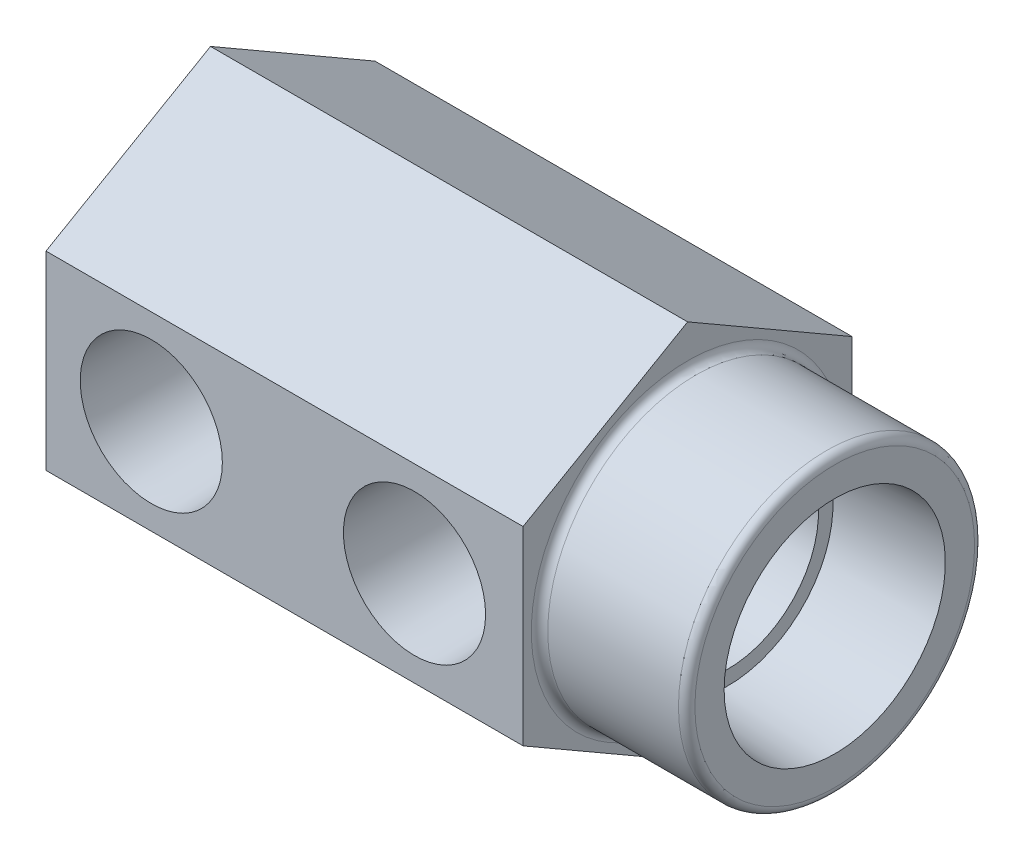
ISO-10303-21;
HEADER;
FILE_DESCRIPTION(('STEP AP214'),'2;1');
FILE_NAME('part.step','',(''),(''),'','','');
FILE_SCHEMA(('AUTOMOTIVE_DESIGN { 1 0 10303 214 1 1 1 1 }'));
ENDSEC;
DATA;
#1=APPLICATION_CONTEXT('core data for automotive mechanical design processes');
#2=APPLICATION_PROTOCOL_DEFINITION('international standard','automotive_design',2000,#1);
#3=PRODUCT_CONTEXT('',#1,'mechanical');
#4=PRODUCT('Part','Part','',(#3));
#5=PRODUCT_RELATED_PRODUCT_CATEGORY('part','',(#4));
#6=PRODUCT_DEFINITION_FORMATION('','',#4);
#7=PRODUCT_DEFINITION_CONTEXT('part definition',#1,'design');
#8=PRODUCT_DEFINITION('design','',#6,#7);
#9=PRODUCT_DEFINITION_SHAPE('','',#8);
#10=(LENGTH_UNIT() NAMED_UNIT(*) SI_UNIT(.MILLI.,.METRE.));
#11=(NAMED_UNIT(*) PLANE_ANGLE_UNIT() SI_UNIT($,.RADIAN.));
#12=(NAMED_UNIT(*) SI_UNIT($,.STERADIAN.) SOLID_ANGLE_UNIT());
#13=UNCERTAINTY_MEASURE_WITH_UNIT(LENGTH_MEASURE(1.E-05),#10,'distance_accuracy_value','');
#14=(GEOMETRIC_REPRESENTATION_CONTEXT(3) GLOBAL_UNCERTAINTY_ASSIGNED_CONTEXT((#13)) GLOBAL_UNIT_ASSIGNED_CONTEXT((#10,
#11,#12)) REPRESENTATION_CONTEXT('',''));
#15=CARTESIAN_POINT('',(0.,0.,0.));
#16=DIRECTION('',(0.,0.,1.));
#17=DIRECTION('',(1.,0.,0.));
#18=AXIS2_PLACEMENT_3D('',#15,#16,#17);
#19=CARTESIAN_POINT('',(35.56,0.,3.175));
#20=DIRECTION('',(0.,0.,1.));
#21=DIRECTION('',(1.,0.,0.));
#22=AXIS2_PLACEMENT_3D('',#19,#20,#21);
#23=CONICAL_SURFACE('',#22,5.5626,1.02974425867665);
#24=CARTESIAN_POINT('',(35.56,0.,3.175));
#25=DIRECTION('',(0.,0.,1.));
#26=DIRECTION('',(1.,0.,0.));
#27=AXIS2_PLACEMENT_3D('',#24,#25,#26);
#28=CIRCLE('',#27,5.5626);
#29=CARTESIAN_POINT('',(36.1061,5.53572881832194,3.175));
#30=VERTEX_POINT('',#29);
#31=CARTESIAN_POINT('',(32.3739005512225,4.55974660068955,3.175));
#32=VERTEX_POINT('',#31);
#33=EDGE_CURVE('E173',#30,#32,#28,.T.);
#34=ORIENTED_EDGE('',*,*,#33,.T.);
#35=CARTESIAN_POINT('',(31.971370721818,4.48268233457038,3.28290620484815));
#36=CARTESIAN_POINT('',(32.2195475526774,4.5334493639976,3.21356814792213));
#37=CARTESIAN_POINT('',(32.4702039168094,4.57859789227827,3.14855400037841));
#38=CARTESIAN_POINT('',(32.9763712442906,4.65793775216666,3.02996246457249));
#39=CARTESIAN_POINT('',(33.2318899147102,4.69210982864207,2.97640522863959));
#40=CARTESIAN_POINT('',(33.7422722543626,4.74909450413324,2.88459450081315));
#41=CARTESIAN_POINT('',(33.9970681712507,4.77209660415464,2.84608804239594));
#42=CARTESIAN_POINT('',(34.5091518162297,4.80760622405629,2.78569231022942));
#43=CARTESIAN_POINT('',(34.7664371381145,4.82012301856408,2.76378835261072));
#44=CARTESIAN_POINT('',(35.2801366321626,4.83459432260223,2.73840112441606));
#45=CARTESIAN_POINT('',(35.5365405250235,4.83663498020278,2.73476761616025));
#46=CARTESIAN_POINT('',(35.9218073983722,4.83192896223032,2.74305811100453));
#47=CARTESIAN_POINT('',(36.0509093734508,4.82903566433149,2.74816497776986));
#48=CARTESIAN_POINT('',(36.3087687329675,4.82062323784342,2.76289112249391));
#49=CARTESIAN_POINT('',(36.4375261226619,4.81510414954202,2.77251033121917));
#50=CARTESIAN_POINT('',(36.566022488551,4.80827453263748,2.78431501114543));
#51=B_SPLINE_CURVE_WITH_KNOTS('',3,(#35,#36,#37,#38,#39,#40,#41,#42,#43,#44,#45,#46,#47,#48,#49,
#50),.UNSPECIFIED.,.F.,.F.,(4,2,2,2,2,2,2,4),(0.,0.787972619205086,1.57732006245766,
2.35276260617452,3.12751851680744,3.89589307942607,4.28350660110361,4.67111417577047),.UNSPECIFIED.);
#52=CARTESIAN_POINT('',(36.1061,4.82709131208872,2.75156383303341));
#53=VERTEX_POINT('',#52);
#54=EDGE_CURVE('E50',#32,#53,#51,.T.);
#55=ORIENTED_EDGE('',*,*,#54,.T.);
#56=CARTESIAN_POINT('',(36.1061,-28.2240395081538,16.7945407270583));
#57=CARTESIAN_POINT('',(36.1061,-27.2410442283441,16.204009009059));
#58=CARTESIAN_POINT('',(36.1061,-26.2580446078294,15.6134845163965));
#59=CARTESIAN_POINT('',(36.1061,-24.2920308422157,14.4324593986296));
#60=CARTESIAN_POINT('',(36.1061,-23.3090166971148,13.8419587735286));
#61=CARTESIAN_POINT('',(36.1061,-21.3429632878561,12.66098795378));
#62=CARTESIAN_POINT('',(36.1061,-20.3599240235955,12.0705177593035));
#63=CARTESIAN_POINT('',(36.1061,-18.3938146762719,10.8896289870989));
#64=CARTESIAN_POINT('',(36.1061,-17.410744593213,10.2992104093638));
#65=CARTESIAN_POINT('',(36.1061,-15.4486424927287,9.12091026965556));
#66=CARTESIAN_POINT('',(36.1061,-14.4696106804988,8.53302836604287));
#67=CARTESIAN_POINT('',(36.1061,-12.5114562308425,7.35741498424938));
#68=CARTESIAN_POINT('',(36.1061,-11.5323335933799,6.76968350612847));
#69=CARTESIAN_POINT('',(36.1061,-9.57392101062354,5.59450775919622));
#70=CARTESIAN_POINT('',(36.1061,-8.59463106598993,5.00706348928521));
#71=CARTESIAN_POINT('',(36.1061,-7.12533786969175,4.1264956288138));
#72=CARTESIAN_POINT('',(36.1061,-6.63551391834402,3.83307286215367));
#73=CARTESIAN_POINT('',(36.1061,-5.65564068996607,3.24660385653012));
#74=CARTESIAN_POINT('',(36.1061,-5.16559141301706,2.95355761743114));
#75=CARTESIAN_POINT('',(36.1061,-4.48553738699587,2.54770611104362));
#76=CARTESIAN_POINT('',(36.1061,-4.29575276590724,2.43453206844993));
#77=CARTESIAN_POINT('',(36.1061,-3.91606443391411,2.2083820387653));
#78=CARTESIAN_POINT('',(36.1061,-3.72616072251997,2.09540605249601));
#79=CARTESIAN_POINT('',(36.1061,-3.34603165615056,1.86967770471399));
#80=CARTESIAN_POINT('',(36.1061,-3.15580616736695,1.75692556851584));
#81=CARTESIAN_POINT('',(36.1061,-2.77505897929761,1.53192622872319));
#82=CARTESIAN_POINT('',(36.1061,-2.58453728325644,1.41967901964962));
#83=CARTESIAN_POINT('',(36.1061,-2.29425738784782,1.24963512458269));
#84=CARTESIAN_POINT('',(36.1061,-2.1947028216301,1.19149099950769));
#85=CARTESIAN_POINT('',(36.1061,-1.99536574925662,1.07558778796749));
#86=CARTESIAN_POINT('',(36.1061,-1.89558323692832,1.01782871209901));
#87=CARTESIAN_POINT('',(36.1061,-1.69580348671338,0.902982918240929));
#88=CARTESIAN_POINT('',(36.1061,-1.59580669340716,0.845895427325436));
#89=CARTESIAN_POINT('',(36.1061,-1.39526666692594,0.732697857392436));
#90=CARTESIAN_POINT('',(36.1061,-1.29472347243,0.676587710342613));
#91=CARTESIAN_POINT('',(36.1061,-1.13983986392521,0.591967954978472));
#92=CARTESIAN_POINT('',(36.1061,-1.08585527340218,0.562808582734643));
#93=CARTESIAN_POINT('',(36.1061,-0.977481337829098,0.505253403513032));
#94=CARTESIAN_POINT('',(36.1061,-0.923092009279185,0.476857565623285));
#95=CARTESIAN_POINT('',(36.1061,-0.813475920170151,0.421101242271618));
#96=CARTESIAN_POINT('',(36.1061,-0.758246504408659,0.393745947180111));
#97=CARTESIAN_POINT('',(36.1061,-0.646900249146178,0.340912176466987));
#98=CARTESIAN_POINT('',(36.1061,-0.590783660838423,0.31543318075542));
#99=CARTESIAN_POINT('',(36.1061,-0.501289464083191,0.277849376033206));
#100=CARTESIAN_POINT('',(36.1061,-0.468376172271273,0.264660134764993));
#101=CARTESIAN_POINT('',(36.1061,-0.401987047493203,0.239794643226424));
#102=CARTESIAN_POINT('',(36.1061,-0.36851103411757,0.228118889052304));
#103=CARTESIAN_POINT('',(36.1061,-0.267610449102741,0.196453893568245));
#104=CARTESIAN_POINT('',(36.1061,-0.199064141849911,0.179529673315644));
#105=CARTESIAN_POINT('',(36.1061,-0.100718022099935,0.165890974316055));
#106=CARTESIAN_POINT('',(36.1061,-0.0717594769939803,0.163145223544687));
#107=CARTESIAN_POINT('',(36.1061,-0.0137135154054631,0.160426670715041));
#108=CARTESIAN_POINT('',(36.1061,0.0153738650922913,0.160453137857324));
#109=CARTESIAN_POINT('',(36.1061,0.0735339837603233,0.163282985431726));
#110=CARTESIAN_POINT('',(36.1061,0.102606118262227,0.166098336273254));
#111=CARTESIAN_POINT('',(36.1061,0.160391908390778,0.174224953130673));
#112=CARTESIAN_POINT('',(36.1061,0.189105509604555,0.179536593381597));
#113=CARTESIAN_POINT('',(36.1061,0.261758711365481,0.195691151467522));
#114=CARTESIAN_POINT('',(36.1061,0.305373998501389,0.207969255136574));
#115=CARTESIAN_POINT('',(36.1061,0.391557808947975,0.235819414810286));
#116=CARTESIAN_POINT('',(36.1061,0.434124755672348,0.251396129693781));
#117=CARTESIAN_POINT('',(36.1061,0.518590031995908,0.28475646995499));
#118=CARTESIAN_POINT('',(36.1061,0.560484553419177,0.302549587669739));
#119=CARTESIAN_POINT('',(36.1061,0.643609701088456,0.339546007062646));
#120=CARTESIAN_POINT('',(36.1061,0.684840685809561,0.358748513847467));
#121=CARTESIAN_POINT('',(36.1061,0.767542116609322,0.398457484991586));
#122=CARTESIAN_POINT('',(36.1061,0.809004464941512,0.418980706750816));
#123=CARTESIAN_POINT('',(36.1061,0.891575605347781,0.460728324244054));
#124=CARTESIAN_POINT('',(36.1061,0.932684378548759,0.481952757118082));
#125=CARTESIAN_POINT('',(36.1061,1.0553809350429,0.546245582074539));
#126=CARTESIAN_POINT('',(36.1061,1.13658057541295,0.590052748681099));
#127=CARTESIAN_POINT('',(36.1061,1.29650766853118,0.677739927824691));
#128=CARTESIAN_POINT('',(36.1061,1.37524894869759,0.721594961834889));
#129=CARTESIAN_POINT('',(36.1061,1.53235983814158,0.809969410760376));
#130=CARTESIAN_POINT('',(36.1061,1.61072943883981,0.85448884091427));
#131=CARTESIAN_POINT('',(36.1061,1.8454819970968,0.988692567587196));
#132=CARTESIAN_POINT('',(36.1061,2.0014984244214,1.07901656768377));
#133=CARTESIAN_POINT('',(36.1061,2.31322637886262,1.26060812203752));
#134=CARTESIAN_POINT('',(36.1061,2.46893732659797,1.35187666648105));
#135=CARTESIAN_POINT('',(36.1061,2.78006502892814,1.53490063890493));
#136=CARTESIAN_POINT('',(36.1061,2.93548179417,1.62665604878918));
#137=CARTESIAN_POINT('',(36.1061,3.24368338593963,1.80901902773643));
#138=CARTESIAN_POINT('',(36.1061,3.39647102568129,1.89962184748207));
#139=CARTESIAN_POINT('',(36.1061,3.70193039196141,2.08102605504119));
#140=CARTESIAN_POINT('',(36.1061,3.85460211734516,2.17182744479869));
#141=CARTESIAN_POINT('',(36.1061,4.3123683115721,2.44436054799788));
#142=CARTESIAN_POINT('',(36.1061,4.61734105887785,2.62629665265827));
#143=CARTESIAN_POINT('',(36.1061,5.5238618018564,3.16766246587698));
#144=CARTESIAN_POINT('',(36.1061,6.12516662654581,3.52749910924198));
#145=CARTESIAN_POINT('',(36.1061,7.32752421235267,4.24759500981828));
#146=CARTESIAN_POINT('',(36.1061,7.92857697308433,4.6078542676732));
#147=CARTESIAN_POINT('',(36.1061,9.13066140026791,5.32866239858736));
#148=CARTESIAN_POINT('',(36.1061,9.73169304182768,5.68921131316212));
#149=CARTESIAN_POINT('',(36.1061,10.933681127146,6.41043377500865));
#150=CARTESIAN_POINT('',(36.1061,11.5346375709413,6.77110732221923));
#151=CARTESIAN_POINT('',(36.1061,13.3881993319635,7.88371083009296));
#152=CARTESIAN_POINT('',(36.1061,14.6407285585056,8.63576755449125));
#153=CARTESIAN_POINT('',(36.1061,16.5193369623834,9.76388654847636));
#154=CARTESIAN_POINT('',(36.1061,17.1454482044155,10.1398954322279));
#155=CARTESIAN_POINT('',(36.1061,18.3976538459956,10.8919409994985));
#156=CARTESIAN_POINT('',(36.1061,19.0237482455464,11.2679776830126));
#157=CARTESIAN_POINT('',(36.1061,19.6498365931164,11.6440244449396));
#158=B_SPLINE_CURVE_WITH_KNOTS('',3,(#56,#57,#58,#59,#60,#61,#62,#63,#64,#65,#66,#67,#68,#69,
#70,#71,#72,#73,#74,#75,#76,#77,#78,#79,#80,#81,#82,#83,#84,#85,#86,#87,#88,#89,#90,#91,#92,#93,
#94,#95,#96,#97,#98,#99,#100,#101,#102,#103,#104,#105,#106,#107,#108,#109,#110,#111,#112,#113,
#114,#115,#116,#117,#118,#119,#120,#121,#122,#123,#124,#125,#126,#127,#128,#129,#130,#131,#132,
#133,#134,#135,#136,#137,#138,#139,#140,#141,#142,#143,#144,#145,#146,#147,#148,#149,#150,#151,
#152,#153,#154,#155,#156,#157),.UNSPECIFIED.,.F.,.F.,(4,2,2,2,2,2,2,2,2,2,2,2,2,2,2,2,2,2,2,2,2,
2,2,2,2,2,2,2,2,2,2,2,2,2,2,2,2,2,2,2,2,2,2,2,2,2,2,2,2,2,4),(0.,3.44021320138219,
6.88042688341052,10.3206581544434,13.7608889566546,17.1868159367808,20.6127442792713,
24.038659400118,25.7516158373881,27.4645716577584,28.1274736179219,28.7903783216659,
29.4537701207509,30.1171547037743,30.463025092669,30.8089049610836,31.1543375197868,
31.4997459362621,31.6838112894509,31.8678691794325,32.0527490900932,32.2375775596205,
32.3439108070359,32.4502788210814,32.6608790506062,32.7480261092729,32.8351501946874,
32.9226498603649,33.0101626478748,33.1458755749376,33.2817814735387,33.4182908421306,
33.5547238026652,33.6935055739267,33.83229470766,34.1090649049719,34.3794522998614,
34.6498459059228,35.1906684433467,35.7321310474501,36.273573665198,36.8064678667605,
37.3393673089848,38.4047223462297,40.5069703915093,42.6092216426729,44.7118654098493,
46.8145081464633,51.1974031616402,53.3884261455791,55.5794487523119),.UNSPECIFIED.);
#159=EDGE_CURVE('E248',#53,#30,#158,.T.);
#160=ORIENTED_EDGE('',*,*,#159,.T.);
#161=EDGE_LOOP('',(#34,#55,#160));
#162=FACE_BOUND('',#161,.T.);
#163=ADVANCED_FACE('F34',(#162),#23,.F.);
#164=CARTESIAN_POINT('',(60.2361,0.,0.));
#165=DIRECTION('',(1.,0.,0.));
#166=DIRECTION('',(0.,0.,-1.));
#167=AXIS2_PLACEMENT_3D('',#164,#165,#166);
#168=PLANE('',#167);
#169=CARTESIAN_POINT('',(60.2361,0.,0.));
#170=DIRECTION('',(1.,0.,0.));
#171=DIRECTION('',(0.,0.,-1.));
#172=AXIS2_PLACEMENT_3D('',#169,#170,#171);
#173=CIRCLE('',#172,13.49375);
#174=CARTESIAN_POINT('',(60.2361,0.,-13.49375));
#175=VERTEX_POINT('',#174);
#176=EDGE_CURVE('E480',#175,#175,#173,.T.);
#177=ORIENTED_EDGE('',*,*,#176,.T.);
#178=EDGE_LOOP('',(#177));
#179=FACE_BOUND('',#178,.T.);
#180=CARTESIAN_POINT('',(60.2361,0.,0.));
#181=DIRECTION('',(-1.,0.,0.));
#182=DIRECTION('',(0.,0.,1.));
#183=AXIS2_PLACEMENT_3D('',#180,#181,#182);
#184=CIRCLE('',#183,10.6743844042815);
#185=CARTESIAN_POINT('',(60.2361,0.,10.6743844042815));
#186=VERTEX_POINT('',#185);
#187=EDGE_CURVE('E201',#186,#186,#184,.T.);
#188=ORIENTED_EDGE('',*,*,#187,.T.);
#189=EDGE_LOOP('',(#188));
#190=FACE_BOUND('',#189,.T.);
#191=ADVANCED_FACE('F416',(#179,#190),#168,.T.);
#192=CARTESIAN_POINT('',(46.0375,-9.16543552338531,-15.875));
#193=DIRECTION('',(1.,0.,0.));
#194=DIRECTION('',(0.,0.,-1.));
#195=AXIS2_PLACEMENT_3D('',#192,#193,#194);
#196=PLANE('',#195);
#197=CARTESIAN_POINT('',(46.0375,0.,0.));
#198=DIRECTION('',(1.,0.,0.));
#199=DIRECTION('',(0.,0.,-1.));
#200=AXIS2_PLACEMENT_3D('',#197,#198,#199);
#201=CIRCLE('',#200,15.08125);
#202=CARTESIAN_POINT('',(46.0375,0.,-15.08125));
#203=VERTEX_POINT('',#202);
#204=EDGE_CURVE('E490',#203,#203,#201,.F.);
#205=ORIENTED_EDGE('',*,*,#204,.T.);
#206=EDGE_LOOP('',(#205));
#207=FACE_BOUND('',#206,.T.);
#208=DIRECTION('',(0.,0.5,-0.866025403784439));
#209=VECTOR('',#208,1.);
#210=CARTESIAN_POINT('',(46.0375,-18.3308710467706,0.));
#211=LINE('',#210,#209);
#212=CARTESIAN_POINT('',(46.0375,-18.3308710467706,0.));
#213=VERTEX_POINT('',#212);
#214=CARTESIAN_POINT('',(46.0375,-9.16543552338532,-15.875));
#215=VERTEX_POINT('',#214);
#216=EDGE_CURVE('E205',#213,#215,#211,.T.);
#217=ORIENTED_EDGE('',*,*,#216,.T.);
#218=DIRECTION('',(0.,1.,0.));
#219=VECTOR('',#218,1.);
#220=CARTESIAN_POINT('',(46.0375,-9.16543552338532,-15.875));
#221=LINE('',#220,#219);
#222=CARTESIAN_POINT('',(46.0375,9.16543552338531,-15.875));
#223=VERTEX_POINT('',#222);
#224=EDGE_CURVE('E208',#215,#223,#221,.T.);
#225=ORIENTED_EDGE('',*,*,#224,.T.);
#226=DIRECTION('',(0.,0.5,0.866025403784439));
#227=VECTOR('',#226,1.);
#228=CARTESIAN_POINT('',(46.0375,9.16543552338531,-15.875));
#229=LINE('',#228,#227);
#230=CARTESIAN_POINT('',(46.0375,18.3308710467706,0.));
#231=VERTEX_POINT('',#230);
#232=EDGE_CURVE('E211',#223,#231,#229,.T.);
#233=ORIENTED_EDGE('',*,*,#232,.T.);
#234=DIRECTION('',(0.,-0.5,0.866025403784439));
#235=VECTOR('',#234,1.);
#236=CARTESIAN_POINT('',(46.0375,18.3308710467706,0.));
#237=LINE('',#236,#235);
#238=CARTESIAN_POINT('',(46.0375,9.16543552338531,15.875));
#239=VERTEX_POINT('',#238);
#240=EDGE_CURVE('E213',#231,#239,#237,.T.);
#241=ORIENTED_EDGE('',*,*,#240,.T.);
#242=DIRECTION('',(0.,-1.,0.));
#243=VECTOR('',#242,1.);
#244=CARTESIAN_POINT('',(46.0375,9.16543552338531,15.875));
#245=LINE('',#244,#243);
#246=CARTESIAN_POINT('',(46.0375,-9.16543552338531,15.875));
#247=VERTEX_POINT('',#246);
#248=EDGE_CURVE('E215',#239,#247,#245,.T.);
#249=ORIENTED_EDGE('',*,*,#248,.T.);
#250=DIRECTION('',(0.,-0.5,-0.866025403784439));
#251=VECTOR('',#250,1.);
#252=CARTESIAN_POINT('',(46.0375,-9.16543552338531,15.875));
#253=LINE('',#252,#251);
#254=EDGE_CURVE('E217',#247,#213,#253,.T.);
#255=ORIENTED_EDGE('',*,*,#254,.T.);
#256=EDGE_LOOP('',(#217,#225,#233,#241,#249,#255));
#257=FACE_BOUND('',#256,.T.);
#258=ADVANCED_FACE('F420',(#207,#257),#196,.T.);
#259=CARTESIAN_POINT('',(46.0375,-18.3308710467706,0.));
#260=DIRECTION('',(0.,0.866025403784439,0.5));
#261=DIRECTION('',(0.,-0.5,0.866025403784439));
#262=AXIS2_PLACEMENT_3D('',#259,#260,#261);
#263=PLANE('',#262);
#264=DIRECTION('',(0.,0.5,-0.866025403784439));
#265=VECTOR('',#264,1.);
#266=CARTESIAN_POINT('',(0.,-18.3308710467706,0.));
#267=LINE('',#266,#265);
#268=CARTESIAN_POINT('',(0.,-18.3308710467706,0.));
#269=VERTEX_POINT('',#268);
#270=CARTESIAN_POINT('',(0.,-9.16543552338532,-15.875));
#271=VERTEX_POINT('',#270);
#272=EDGE_CURVE('E204',#269,#271,#267,.T.);
#273=ORIENTED_EDGE('',*,*,#272,.T.);
#274=DIRECTION('',(-1.,0.,0.));
#275=VECTOR('',#274,1.);
#276=CARTESIAN_POINT('',(46.0375,-9.16543552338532,-15.875));
#277=LINE('',#276,#275);
#278=EDGE_CURVE('E245',#215,#271,#277,.T.);
#279=ORIENTED_EDGE('',*,*,#278,.F.);
#280=ORIENTED_EDGE('',*,*,#216,.F.);
#281=DIRECTION('',(-1.,0.,0.));
#282=VECTOR('',#281,1.);
#283=CARTESIAN_POINT('',(46.0375,-18.3308710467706,0.));
#284=LINE('',#283,#282);
#285=EDGE_CURVE('E219',#213,#269,#284,.T.);
#286=ORIENTED_EDGE('',*,*,#285,.T.);
#287=EDGE_LOOP('',(#273,#279,#280,#286));
#288=FACE_BOUND('',#287,.T.);
#289=ADVANCED_FACE('F426',(#288),#263,.F.);
#290=CARTESIAN_POINT('',(46.0375,-9.16543552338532,-15.875));
#291=DIRECTION('',(0.,0.,1.));
#292=DIRECTION('',(1.,0.,0.));
#293=AXIS2_PLACEMENT_3D('',#290,#291,#292);
#294=PLANE('',#293);
#295=CARTESIAN_POINT('',(10.16,0.,-15.875));
#296=DIRECTION('',(0.,0.,-1.));
#297=DIRECTION('',(-1.,0.,0.));
#298=AXIS2_PLACEMENT_3D('',#295,#296,#297);
#299=CIRCLE('',#298,6.858);
#300=CARTESIAN_POINT('',(3.302,0.,-15.875));
#301=VERTEX_POINT('',#300);
#302=EDGE_CURVE('E176',#301,#301,#299,.T.);
#303=ORIENTED_EDGE('',*,*,#302,.F.);
#304=EDGE_LOOP('',(#303));
#305=FACE_BOUND('',#304,.T.);
#306=DIRECTION('',(0.,1.,0.));
#307=VECTOR('',#306,1.);
#308=CARTESIAN_POINT('',(0.,-9.16543552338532,-15.875));
#309=LINE('',#308,#307);
#310=CARTESIAN_POINT('',(0.,9.16543552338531,-15.875));
#311=VERTEX_POINT('',#310);
#312=EDGE_CURVE('E222',#271,#311,#309,.T.);
#313=ORIENTED_EDGE('',*,*,#312,.T.);
#314=DIRECTION('',(-1.,0.,0.));
#315=VECTOR('',#314,1.);
#316=CARTESIAN_POINT('',(46.0375,9.16543552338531,-15.875));
#317=LINE('',#316,#315);
#318=EDGE_CURVE('E242',#223,#311,#317,.T.);
#319=ORIENTED_EDGE('',*,*,#318,.F.);
#320=ORIENTED_EDGE('',*,*,#224,.F.);
#321=ORIENTED_EDGE('',*,*,#278,.T.);
#322=EDGE_LOOP('',(#313,#319,#320,#321));
#323=FACE_BOUND('',#322,.T.);
#324=ADVANCED_FACE('F457',(#305,#323),#294,.F.);
#325=CARTESIAN_POINT('',(46.0375,9.16543552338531,-15.875));
#326=DIRECTION('',(0.,-0.866025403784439,0.5));
#327=DIRECTION('',(0.,-0.5,-0.866025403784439));
#328=AXIS2_PLACEMENT_3D('',#325,#326,#327);
#329=PLANE('',#328);
#330=DIRECTION('',(0.,0.5,0.866025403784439));
#331=VECTOR('',#330,1.);
#332=CARTESIAN_POINT('',(0.,9.16543552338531,-15.875));
#333=LINE('',#332,#331);
#334=CARTESIAN_POINT('',(0.,18.3308710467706,0.));
#335=VERTEX_POINT('',#334);
#336=EDGE_CURVE('E224',#311,#335,#333,.T.);
#337=ORIENTED_EDGE('',*,*,#336,.T.);
#338=DIRECTION('',(-1.,0.,0.));
#339=VECTOR('',#338,1.);
#340=CARTESIAN_POINT('',(46.0375,18.3308710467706,0.));
#341=LINE('',#340,#339);
#342=EDGE_CURVE('E239',#231,#335,#341,.T.);
#343=ORIENTED_EDGE('',*,*,#342,.F.);
#344=ORIENTED_EDGE('',*,*,#232,.F.);
#345=ORIENTED_EDGE('',*,*,#318,.T.);
#346=EDGE_LOOP('',(#337,#343,#344,#345));
#347=FACE_BOUND('',#346,.T.);
#348=ADVANCED_FACE('F453',(#347),#329,.F.);
#349=CARTESIAN_POINT('',(46.0375,18.3308710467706,0.));
#350=DIRECTION('',(0.,-0.866025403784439,-0.5));
#351=DIRECTION('',(0.,0.5,-0.866025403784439));
#352=AXIS2_PLACEMENT_3D('',#349,#350,#351);
#353=PLANE('',#352);
#354=DIRECTION('',(0.,-0.5,0.866025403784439));
#355=VECTOR('',#354,1.);
#356=CARTESIAN_POINT('',(0.,18.3308710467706,0.));
#357=LINE('',#356,#355);
#358=CARTESIAN_POINT('',(0.,9.16543552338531,15.875));
#359=VERTEX_POINT('',#358);
#360=EDGE_CURVE('E226',#335,#359,#357,.T.);
#361=ORIENTED_EDGE('',*,*,#360,.T.);
#362=DIRECTION('',(-1.,0.,0.));
#363=VECTOR('',#362,1.);
#364=CARTESIAN_POINT('',(46.0375,9.16543552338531,15.875));
#365=LINE('',#364,#363);
#366=EDGE_CURVE('E236',#239,#359,#365,.T.);
#367=ORIENTED_EDGE('',*,*,#366,.F.);
#368=ORIENTED_EDGE('',*,*,#240,.F.);
#369=ORIENTED_EDGE('',*,*,#342,.T.);
#370=EDGE_LOOP('',(#361,#367,#368,#369));
#371=FACE_BOUND('',#370,.T.);
#372=ADVANCED_FACE('F449',(#371),#353,.F.);
#373=CARTESIAN_POINT('',(46.0375,9.16543552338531,15.875));
#374=DIRECTION('',(0.,0.,-1.));
#375=DIRECTION('',(-1.,0.,0.));
#376=AXIS2_PLACEMENT_3D('',#373,#374,#375);
#377=PLANE('',#376);
#378=CARTESIAN_POINT('',(10.16,0.,15.875));
#379=DIRECTION('',(0.,0.,1.));
#380=DIRECTION('',(1.,0.,0.));
#381=AXIS2_PLACEMENT_3D('',#378,#379,#380);
#382=CIRCLE('',#381,6.858);
#383=CARTESIAN_POINT('',(17.018,0.,15.875));
#384=VERTEX_POINT('',#383);
#385=EDGE_CURVE('E502',#384,#384,#382,.T.);
#386=ORIENTED_EDGE('',*,*,#385,.F.);
#387=EDGE_LOOP('',(#386));
#388=FACE_BOUND('',#387,.T.);
#389=CARTESIAN_POINT('',(35.56,0.,15.875));
#390=DIRECTION('',(0.,0.,1.));
#391=DIRECTION('',(1.,0.,0.));
#392=AXIS2_PLACEMENT_3D('',#389,#390,#391);
#393=CIRCLE('',#392,6.858);
#394=CARTESIAN_POINT('',(42.418,0.,15.875));
#395=VERTEX_POINT('',#394);
#396=EDGE_CURVE('E515',#395,#395,#393,.T.);
#397=ORIENTED_EDGE('',*,*,#396,.F.);
#398=EDGE_LOOP('',(#397));
#399=FACE_BOUND('',#398,.T.);
#400=DIRECTION('',(0.,-1.,0.));
#401=VECTOR('',#400,1.);
#402=CARTESIAN_POINT('',(0.,9.16543552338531,15.875));
#403=LINE('',#402,#401);
#404=CARTESIAN_POINT('',(0.,-9.16543552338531,15.875));
#405=VERTEX_POINT('',#404);
#406=EDGE_CURVE('E228',#359,#405,#403,.T.);
#407=ORIENTED_EDGE('',*,*,#406,.T.);
#408=DIRECTION('',(-1.,0.,0.));
#409=VECTOR('',#408,1.);
#410=CARTESIAN_POINT('',(46.0375,-9.16543552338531,15.875));
#411=LINE('',#410,#409);
#412=EDGE_CURVE('E233',#247,#405,#411,.T.);
#413=ORIENTED_EDGE('',*,*,#412,.F.);
#414=ORIENTED_EDGE('',*,*,#248,.F.);
#415=ORIENTED_EDGE('',*,*,#366,.T.);
#416=EDGE_LOOP('',(#407,#413,#414,#415));
#417=FACE_BOUND('',#416,.T.);
#418=ADVANCED_FACE('F445',(#388,#399,#417),#377,.F.);
#419=CARTESIAN_POINT('',(46.0375,-9.16543552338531,15.875));
#420=DIRECTION('',(0.,0.866025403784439,-0.5));
#421=DIRECTION('',(0.,0.5,0.866025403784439));
#422=AXIS2_PLACEMENT_3D('',#419,#420,#421);
#423=PLANE('',#422);
#424=DIRECTION('',(0.,-0.5,-0.866025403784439));
#425=VECTOR('',#424,1.);
#426=CARTESIAN_POINT('',(0.,-9.16543552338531,15.875));
#427=LINE('',#426,#425);
#428=EDGE_CURVE('E209',#405,#269,#427,.T.);
#429=ORIENTED_EDGE('',*,*,#428,.T.);
#430=ORIENTED_EDGE('',*,*,#285,.F.);
#431=ORIENTED_EDGE('',*,*,#254,.F.);
#432=ORIENTED_EDGE('',*,*,#412,.T.);
#433=EDGE_LOOP('',(#429,#430,#431,#432));
#434=FACE_BOUND('',#433,.T.);
#435=ADVANCED_FACE('F441',(#434),#423,.F.);
#436=CARTESIAN_POINT('',(0.,-9.16543552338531,-15.875));
#437=DIRECTION('',(1.,0.,0.));
#438=DIRECTION('',(0.,0.,-1.));
#439=AXIS2_PLACEMENT_3D('',#436,#437,#438);
#440=PLANE('',#439);
#441=ORIENTED_EDGE('',*,*,#272,.F.);
#442=ORIENTED_EDGE('',*,*,#428,.F.);
#443=ORIENTED_EDGE('',*,*,#406,.F.);
#444=ORIENTED_EDGE('',*,*,#360,.F.);
#445=ORIENTED_EDGE('',*,*,#336,.F.);
#446=ORIENTED_EDGE('',*,*,#312,.F.);
#447=EDGE_LOOP('',(#441,#442,#443,#444,#445,#446));
#448=FACE_BOUND('',#447,.T.);
#449=ADVANCED_FACE('F436',(#448),#440,.F.);
#450=CARTESIAN_POINT('',(60.2361,0.,0.));
#451=DIRECTION('',(-1.,0.,0.));
#452=DIRECTION('',(0.,0.,1.));
#453=AXIS2_PLACEMENT_3D('',#450,#451,#452);
#454=CYLINDRICAL_SURFACE('',#453,14.2875);
#455=CARTESIAN_POINT('',(59.44235,0.,0.));
#456=DIRECTION('',(1.,0.,0.));
#457=DIRECTION('',(0.,0.,-1.));
#458=AXIS2_PLACEMENT_3D('',#455,#456,#457);
#459=CIRCLE('',#458,14.2875);
#460=CARTESIAN_POINT('',(59.44235,0.,14.2875));
#461=VERTEX_POINT('',#460);
#462=EDGE_CURVE('E478',#461,#461,#459,.F.);
#463=CARTESIAN_POINT('',(46.83125,0.,0.));
#464=DIRECTION('',(1.,0.,0.));
#465=DIRECTION('',(0.,0.,-1.));
#466=AXIS2_PLACEMENT_3D('',#463,#464,#465);
#467=CIRCLE('',#466,14.2875);
#468=CARTESIAN_POINT('',(46.83125,0.,14.2875));
#469=VERTEX_POINT('',#468);
#470=EDGE_CURVE('E481',#469,#469,#467,.T.);
#471=CARTESIAN_POINT('',(59.44235,0.,14.2875));
#472=CARTESIAN_POINT('',(59.310984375,0.,14.2875));
#473=CARTESIAN_POINT('',(59.17961875,0.,14.2875));
#474=CARTESIAN_POINT('',(58.9168875,0.,14.2875));
#475=CARTESIAN_POINT('',(58.785521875,0.,14.2875));
#476=CARTESIAN_POINT('',(58.522790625,0.,14.2875));
#477=CARTESIAN_POINT('',(58.391425,0.,14.2875));
#478=CARTESIAN_POINT('',(58.12869375,0.,14.2875));
#479=CARTESIAN_POINT('',(57.997328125,0.,14.2875));
#480=CARTESIAN_POINT('',(57.734596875,0.,14.2875));
#481=CARTESIAN_POINT('',(57.60323125,0.,14.2875));
#482=CARTESIAN_POINT('',(57.3405,0.,14.2875));
#483=CARTESIAN_POINT('',(57.209134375,0.,14.2875));
#484=CARTESIAN_POINT('',(56.946403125,0.,14.2875));
#485=CARTESIAN_POINT('',(56.8150375,0.,14.2875));
#486=CARTESIAN_POINT('',(56.55230625,0.,14.2875));
#487=CARTESIAN_POINT('',(56.420940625,0.,14.2875));
#488=CARTESIAN_POINT('',(56.158209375,0.,14.2875));
#489=CARTESIAN_POINT('',(56.02684375,0.,14.2875));
#490=CARTESIAN_POINT('',(55.7641125,0.,14.2875));
#491=CARTESIAN_POINT('',(55.632746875,0.,14.2875));
#492=CARTESIAN_POINT('',(55.370015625,0.,14.2875));
#493=CARTESIAN_POINT('',(55.23865,0.,14.2875));
#494=CARTESIAN_POINT('',(54.97591875,0.,14.2875));
#495=CARTESIAN_POINT('',(54.844553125,0.,14.2875));
#496=CARTESIAN_POINT('',(54.581821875,0.,14.2875));
#497=CARTESIAN_POINT('',(54.45045625,0.,14.2875));
#498=CARTESIAN_POINT('',(54.187725,0.,14.2875));
#499=CARTESIAN_POINT('',(54.056359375,0.,14.2875));
#500=CARTESIAN_POINT('',(53.793628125,0.,14.2875));
#501=CARTESIAN_POINT('',(53.6622625,0.,14.2875));
#502=CARTESIAN_POINT('',(53.39953125,0.,14.2875));
#503=CARTESIAN_POINT('',(53.268165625,0.,14.2875));
#504=CARTESIAN_POINT('',(53.005434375,0.,14.2875));
#505=CARTESIAN_POINT('',(52.87406875,0.,14.2875));
#506=CARTESIAN_POINT('',(52.6113375,0.,14.2875));
#507=CARTESIAN_POINT('',(52.479971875,0.,14.2875));
#508=CARTESIAN_POINT('',(52.217240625,0.,14.2875));
#509=CARTESIAN_POINT('',(52.085875,0.,14.2875));
#510=CARTESIAN_POINT('',(51.82314375,0.,14.2875));
#511=CARTESIAN_POINT('',(51.691778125,0.,14.2875));
#512=CARTESIAN_POINT('',(51.429046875,0.,14.2875));
#513=CARTESIAN_POINT('',(51.29768125,0.,14.2875));
#514=CARTESIAN_POINT('',(51.03495,0.,14.2875));
#515=CARTESIAN_POINT('',(50.903584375,0.,14.2875));
#516=CARTESIAN_POINT('',(50.640853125,0.,14.2875));
#517=CARTESIAN_POINT('',(50.5094875,0.,14.2875));
#518=CARTESIAN_POINT('',(50.24675625,0.,14.2875));
#519=CARTESIAN_POINT('',(50.115390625,0.,14.2875));
#520=CARTESIAN_POINT('',(49.852659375,0.,14.2875));
#521=CARTESIAN_POINT('',(49.72129375,0.,14.2875));
#522=CARTESIAN_POINT('',(49.4585625,0.,14.2875));
#523=CARTESIAN_POINT('',(49.327196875,0.,14.2875));
#524=CARTESIAN_POINT('',(49.064465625,0.,14.2875));
#525=CARTESIAN_POINT('',(48.9331,0.,14.2875));
#526=CARTESIAN_POINT('',(48.67036875,0.,14.2875));
#527=CARTESIAN_POINT('',(48.539003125,0.,14.2875));
#528=CARTESIAN_POINT('',(48.276271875,0.,14.2875));
#529=CARTESIAN_POINT('',(48.14490625,0.,14.2875));
#530=CARTESIAN_POINT('',(47.882175,0.,14.2875));
#531=CARTESIAN_POINT('',(47.750809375,0.,14.2875));
#532=CARTESIAN_POINT('',(47.488078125,0.,14.2875));
#533=CARTESIAN_POINT('',(47.3567125,0.,14.2875));
#534=CARTESIAN_POINT('',(47.09398125,0.,14.2875));
#535=CARTESIAN_POINT('',(46.962615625,0.,14.2875));
#536=CARTESIAN_POINT('',(46.83125,0.,14.2875));
#537=B_SPLINE_CURVE_WITH_KNOTS('',3,(#471,#472,#473,#474,#475,#476,#477,#478,#479,#480,#481,
#482,#483,#484,#485,#486,#487,#488,#489,#490,#491,#492,#493,#494,#495,#496,#497,#498,#499,#500,
#501,#502,#503,#504,#505,#506,#507,#508,#509,#510,#511,#512,#513,#514,#515,#516,#517,#518,#519,
#520,#521,#522,#523,#524,#525,#526,#527,#528,#529,#530,#531,#532,#533,#534,#535,#536),
.UNSPECIFIED.,.F.,.F.,(4,2,2,2,2,2,2,2,2,2,2,2,2,2,2,2,2,2,2,2,2,2,2,2,2,2,2,2,2,2,2,2,4),(0.,
0.394096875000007,0.788193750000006,1.18229062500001,1.57638750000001,1.970484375,2.36458125,
2.758678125,3.152775,3.546871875,3.94096875,4.335065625,4.7291625,5.123259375,5.51735625,
5.911453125,6.30555,6.699646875,7.09374375,7.487840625,7.8819375,8.276034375,8.67013125,
9.064228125,9.458325,9.852421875,10.24651875,10.640615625,11.0347125,11.428809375,11.82290625,
12.217003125,12.6111),.UNSPECIFIED.);
#538=EDGE_CURVE('BSEAM434',#461,#469,#537,.T.);
#539=ORIENTED_EDGE('',*,*,#462,.T.);
#540=ORIENTED_EDGE('',*,*,#470,.T.);
#541=ORIENTED_EDGE('',*,*,#538,.T.);
#542=ORIENTED_EDGE('',*,*,#538,.F.);
#543=EDGE_LOOP('',(#539,#541,#540,#542));
#544=FACE_BOUND('',#543,.T.);
#545=ADVANCED_FACE('F434',(#544),#454,.T.);
#546=CARTESIAN_POINT('',(60.2361,0.,0.));
#547=DIRECTION('',(1.,0.,0.));
#548=DIRECTION('',(0.,0.,-1.));
#549=AXIS2_PLACEMENT_3D('',#546,#547,#548);
#550=CONICAL_SURFACE('',#549,10.6743844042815,0.0523598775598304);
#551=CARTESIAN_POINT('',(49.9364,0.,0.));
#552=DIRECTION('',(-1.,0.,0.));
#553=DIRECTION('',(0.,0.,1.));
#554=AXIS2_PLACEMENT_3D('',#551,#552,#553);
#555=CIRCLE('',#554,10.1346);
#556=CARTESIAN_POINT('',(49.9364,0.,10.1346));
#557=VERTEX_POINT('',#556);
#558=EDGE_CURVE('E198',#557,#557,#555,.T.);
#559=ORIENTED_EDGE('',*,*,#558,.T.);
#560=EDGE_LOOP('',(#559));
#561=FACE_BOUND('',#560,.T.);
#562=ORIENTED_EDGE('',*,*,#187,.F.);
#563=EDGE_LOOP('',(#562));
#564=FACE_BOUND('',#563,.T.);
#565=ADVANCED_FACE('F433',(#561,#564),#550,.F.);
#566=CARTESIAN_POINT('',(49.9364,0.,-8.73125));
#567=DIRECTION('',(1.,0.,0.));
#568=DIRECTION('',(0.,0.,-1.));
#569=AXIS2_PLACEMENT_3D('',#566,#567,#568);
#570=PLANE('',#569);
#571=CARTESIAN_POINT('',(49.9364,0.,0.));
#572=DIRECTION('',(-1.,0.,0.));
#573=DIRECTION('',(0.,0.,1.));
#574=AXIS2_PLACEMENT_3D('',#571,#572,#573);
#575=CIRCLE('',#574,8.73125);
#576=CARTESIAN_POINT('',(49.9364,0.,8.73125));
#577=VERTEX_POINT('',#576);
#578=EDGE_CURVE('E195',#577,#577,#575,.T.);
#579=ORIENTED_EDGE('',*,*,#578,.T.);
#580=EDGE_LOOP('',(#579));
#581=FACE_BOUND('',#580,.T.);
#582=ORIENTED_EDGE('',*,*,#558,.F.);
#583=EDGE_LOOP('',(#582));
#584=FACE_BOUND('',#583,.T.);
#585=ADVANCED_FACE('F548',(#581,#584),#570,.T.);
#586=CARTESIAN_POINT('',(-14.0019251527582,0.,0.));
#587=DIRECTION('',(-1.,0.,0.));
#588=DIRECTION('',(0.,0.,1.));
#589=AXIS2_PLACEMENT_3D('',#586,#587,#588);
#590=CYLINDRICAL_SURFACE('',#589,8.73125);
#591=DIRECTION('',(-1.,0.,0.));
#592=VECTOR('',#591,1.);
#593=CARTESIAN_POINT('',(-14.0019251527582,-6.47743888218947,5.85470000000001));
#594=LINE('',#593,#592);
#595=CARTESIAN_POINT('',(36.5846323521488,-6.47743888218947,5.85470000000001));
#596=VERTEX_POINT('',#595);
#597=CARTESIAN_POINT('',(36.1061,-6.47743888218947,5.85470000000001));
#598=VERTEX_POINT('',#597);
#599=EDGE_CURVE('E482',#596,#598,#594,.T.);
#600=ORIENTED_EDGE('',*,*,#599,.F.);
#601=CARTESIAN_POINT('',(36.583450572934,6.47761964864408,5.85450000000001));
#602=CARTESIAN_POINT('',(36.7614488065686,6.45042693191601,5.88455494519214));
#603=CARTESIAN_POINT('',(36.9369183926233,6.41631096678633,5.92191923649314));
#604=CARTESIAN_POINT('',(37.2814132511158,6.3352526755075,6.00856820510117));
#605=CARTESIAN_POINT('',(37.4504530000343,6.28834137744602,6.05782401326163));
#606=CARTESIAN_POINT('',(37.7801389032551,6.18302881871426,6.16526204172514));
#607=CARTESIAN_POINT('',(37.9408448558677,6.12473010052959,6.22336364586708));
#608=CARTESIAN_POINT('',(38.2551790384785,5.99710025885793,6.34644681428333));
#609=CARTESIAN_POINT('',(38.4088025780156,5.92776195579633,6.41143284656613));
#610=CARTESIAN_POINT('',(38.7073287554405,5.77933033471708,6.54553043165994));
#611=CARTESIAN_POINT('',(38.8522985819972,5.70033255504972,6.61459856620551));
#612=CARTESIAN_POINT('',(39.1348731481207,5.53252891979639,6.75558203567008));
#613=CARTESIAN_POINT('',(39.2724795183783,5.44372524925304,6.82749673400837));
#614=CARTESIAN_POINT('',(39.6752408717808,5.16221457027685,7.04575021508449));
#615=CARTESIAN_POINT('',(39.9293731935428,4.95489035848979,7.19414455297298));
#616=CARTESIAN_POINT('',(40.3126943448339,4.59122379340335,7.42848774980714));
#617=CARTESIAN_POINT('',(40.4520023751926,4.44646481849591,7.51625214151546));
#618=CARTESIAN_POINT('',(40.7179162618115,4.14323846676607,7.68756000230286));
#619=CARTESIAN_POINT('',(40.8445195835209,3.98476836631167,7.77110262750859));
#620=CARTESIAN_POINT('',(41.0835324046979,3.65493326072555,7.93156801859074));
#621=CARTESIAN_POINT('',(41.1959721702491,3.48359704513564,8.00850478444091));
#622=CARTESIAN_POINT('',(41.4055339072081,3.1284025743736,8.15380839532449));
#623=CARTESIAN_POINT('',(41.5026626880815,2.94454993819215,8.22217904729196));
#624=CARTESIAN_POINT('',(41.6554142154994,2.61797215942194,8.33077547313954));
#625=CARTESIAN_POINT('',(41.7150797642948,2.47797028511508,8.37354996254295));
#626=CARTESIAN_POINT('',(41.8249346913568,2.19257346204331,8.45276654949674));
#627=CARTESIAN_POINT('',(41.8751263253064,2.04717980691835,8.48921015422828));
#628=CARTESIAN_POINT('',(41.9653945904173,1.75180691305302,8.55504419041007));
#629=CARTESIAN_POINT('',(42.0054765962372,1.60183015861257,8.58443836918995));
#630=CARTESIAN_POINT('',(42.0749984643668,1.29813495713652,8.63558220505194));
#631=CARTESIAN_POINT('',(42.1044380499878,1.14441641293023,8.65733166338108));
#632=CARTESIAN_POINT('',(42.1523254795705,0.833620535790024,8.69277717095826));
#633=CARTESIAN_POINT('',(42.1707223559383,0.676531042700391,8.70643587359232));
#634=CARTESIAN_POINT('',(42.1960042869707,0.360916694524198,8.72521948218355));
#635=CARTESIAN_POINT('',(42.202889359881,0.202391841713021,8.73034440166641));
#636=CARTESIAN_POINT('',(42.2050282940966,-0.114771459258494,8.73193577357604));
#637=CARTESIAN_POINT('',(42.2002827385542,-0.273409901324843,8.72840266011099));
#638=CARTESIAN_POINT('',(42.17924377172,-0.589486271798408,8.71276463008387));
#639=CARTESIAN_POINT('',(42.1629508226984,-0.746924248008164,8.70066005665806));
#640=CARTESIAN_POINT('',(42.1206528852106,-1.04825251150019,8.66932467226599));
#641=CARTESIAN_POINT('',(42.0954190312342,-1.19231144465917,8.65066043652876));
#642=CARTESIAN_POINT('',(42.0355624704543,-1.47745425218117,8.60654841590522));
#643=CARTESIAN_POINT('',(42.0009365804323,-1.61853710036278,8.58109833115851));
#644=CARTESIAN_POINT('',(41.9227464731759,-1.89684998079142,8.52389976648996));
#645=CARTESIAN_POINT('',(41.8791843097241,-2.03408089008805,8.49215273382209));
#646=CARTESIAN_POINT('',(41.7835946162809,-2.3041157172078,8.42289844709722));
#647=CARTESIAN_POINT('',(41.7315638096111,-2.43691789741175,8.38538896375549));
#648=CARTESIAN_POINT('',(41.615627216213,-2.70667844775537,8.30240339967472));
#649=CARTESIAN_POINT('',(41.5511439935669,-2.84327342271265,8.25655278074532));
#650=CARTESIAN_POINT('',(41.4137044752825,-3.11026683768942,8.15972769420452));
#651=CARTESIAN_POINT('',(41.3407452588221,-3.24066311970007,8.10875146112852));
#652=CARTESIAN_POINT('',(41.1100842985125,-3.62192830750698,7.94935013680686));
#653=CARTESIAN_POINT('',(40.9405389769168,-3.8630118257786,7.83440857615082));
#654=CARTESIAN_POINT('',(40.5400560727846,-4.35920146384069,7.57131656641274));
#655=CARTESIAN_POINT('',(40.3035637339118,-4.60864383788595,7.42095719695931));
#656=CARTESIAN_POINT('',(39.9232158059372,-4.95232934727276,7.19223425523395));
#657=CARTESIAN_POINT('',(39.7919759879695,-5.06193512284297,7.11535974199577));
#658=CARTESIAN_POINT('',(39.521238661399,-5.27075618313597,6.96208308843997));
#659=CARTESIAN_POINT('',(39.3817436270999,-5.36997455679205,6.88568081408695));
#660=CARTESIAN_POINT('',(39.0969256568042,-5.55631038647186,6.73618423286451));
#661=CARTESIAN_POINT('',(38.9517293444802,-5.64359402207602,6.66305675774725));
#662=CARTESIAN_POINT('',(38.6536756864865,-5.80751036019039,6.52068757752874));
#663=CARTESIAN_POINT('',(38.5008167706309,-5.88414086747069,6.45144667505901));
#664=CARTESIAN_POINT('',(38.0319957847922,-6.09672443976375,6.25315262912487));
#665=CARTESIAN_POINT('',(37.7042684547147,-6.21637423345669,6.13268736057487));
#666=CARTESIAN_POINT('',(37.2370231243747,-6.34570935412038,5.99744409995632));
#667=CARTESIAN_POINT('',(37.1086598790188,-6.37724638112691,5.96382446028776));
#668=CARTESIAN_POINT('',(36.8484917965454,-6.43302507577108,5.90360370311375));
#669=CARTESIAN_POINT('',(36.7166810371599,-6.45725315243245,5.87701567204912));
#670=CARTESIAN_POINT('',(36.583450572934,-6.47761964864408,5.85450000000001));
#671=B_SPLINE_CURVE_WITH_KNOTS('',3,(#601,#602,#603,#604,#605,#606,#607,#608,#609,#610,#611,
#612,#613,#614,#615,#616,#617,#618,#619,#620,#621,#622,#623,#624,#625,#626,#627,#628,#629,#630,
#631,#632,#633,#634,#635,#636,#637,#638,#639,#640,#641,#642,#643,#644,#645,#646,#647,#648,#649,
#650,#651,#652,#653,#654,#655,#656,#657,#658,#659,#660,#661,#662,#663,#664,#665,#666,#667,#668,
#669,#670),.UNSPECIFIED.,.F.,.F.,(4,2,2,2,2,2,2,2,2,2,2,2,2,2,2,2,2,2,2,2,2,2,2,2,2,2,2,2,2,2,2,
2,2,2,4),(0.,0.547038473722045,1.0927620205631,1.63378084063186,2.17515295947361,2.711548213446,
3.24782418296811,4.32385930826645,4.98089945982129,5.6380704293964,6.29381236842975,
6.94926184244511,7.42305735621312,7.8967399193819,8.37017012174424,8.84361263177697,
9.31922383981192,9.79483429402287,10.2704209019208,10.745988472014,11.1878126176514,
11.6297866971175,12.0716593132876,12.5137033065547,12.9868002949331,13.4600607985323,
14.4061150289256,15.5272753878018,16.0893312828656,16.6512195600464,17.2042454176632,
17.7573850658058,18.8576959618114,19.2665204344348,19.6761004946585),.UNSPECIFIED.);
#672=CARTESIAN_POINT('',(36.5846323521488,6.47743888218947,5.85470000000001));
#673=VERTEX_POINT('',#672);
#674=EDGE_CURVE('E395',#673,#596,#671,.T.);
#675=ORIENTED_EDGE('',*,*,#674,.F.);
#676=DIRECTION('',(-1.,0.,0.));
#677=VECTOR('',#676,1.);
#678=CARTESIAN_POINT('',(-14.0019251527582,6.47743888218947,5.85470000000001));
#679=LINE('',#678,#677);
#680=CARTESIAN_POINT('',(36.1061,6.47743888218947,5.85470000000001));
#681=VERTEX_POINT('',#680);
#682=EDGE_CURVE('E400',#681,#673,#679,.F.);
#683=ORIENTED_EDGE('',*,*,#682,.F.);
#684=CARTESIAN_POINT('',(36.1061,0.,0.));
#685=DIRECTION('',(-1.,0.,0.));
#686=DIRECTION('',(0.,0.,1.));
#687=AXIS2_PLACEMENT_3D('',#684,#685,#686);
#688=CIRCLE('',#687,8.73125);
#689=EDGE_CURVE('E192',#681,#598,#688,.T.);
#690=ORIENTED_EDGE('',*,*,#689,.T.);
#691=EDGE_LOOP('',(#600,#675,#683,#690));
#692=FACE_BOUND('',#691,.T.);
#693=ORIENTED_EDGE('',*,*,#578,.F.);
#694=EDGE_LOOP('',(#693));
#695=FACE_BOUND('',#694,.T.);
#696=ADVANCED_FACE('F402',(#692,#695),#590,.F.);
#697=CARTESIAN_POINT('',(36.1061,0.,0.));
#698=DIRECTION('',(1.,0.,0.));
#699=DIRECTION('',(0.,0.,-1.));
#700=AXIS2_PLACEMENT_3D('',#697,#698,#699);
#701=PLANE('',#700);
#702=CARTESIAN_POINT('',(36.1061,0.,0.));
#703=DIRECTION('',(1.,0.,0.));
#704=DIRECTION('',(0.,0.,-1.));
#705=AXIS2_PLACEMENT_3D('',#702,#703,#704);
#706=CIRCLE('',#705,5.55624999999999);
#707=CARTESIAN_POINT('',(36.1061,-4.82709131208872,2.75156383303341));
#708=VERTEX_POINT('',#707);
#709=EDGE_CURVE('E381',#708,#53,#706,.T.);
#710=ORIENTED_EDGE('',*,*,#709,.F.);
#711=CARTESIAN_POINT('',(36.1061,-5.53572881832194,3.175));
#712=VERTEX_POINT('',#711);
#713=EDGE_CURVE('E166',#712,#708,#158,.T.);
#714=ORIENTED_EDGE('',*,*,#713,.F.);
#715=DIRECTION('',(0.,0.,1.));
#716=VECTOR('',#715,1.);
#717=CARTESIAN_POINT('',(36.1061,-5.53572881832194,15.875));
#718=LINE('',#717,#716);
#719=CARTESIAN_POINT('',(36.1061,-5.53572881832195,5.8547));
#720=VERTEX_POINT('',#719);
#721=EDGE_CURVE('E172',#720,#712,#718,.F.);
#722=ORIENTED_EDGE('',*,*,#721,.F.);
#723=DIRECTION('',(0.,1.,0.));
#724=VECTOR('',#723,1.);
#725=CARTESIAN_POINT('',(36.1061,0.,5.85470000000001));
#726=LINE('',#725,#724);
#727=EDGE_CURVE('E392',#598,#720,#726,.T.);
#728=ORIENTED_EDGE('',*,*,#727,.F.);
#729=ORIENTED_EDGE('',*,*,#689,.F.);
#730=CARTESIAN_POINT('',(36.1061,5.53572881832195,5.8547));
#731=VERTEX_POINT('',#730);
#732=EDGE_CURVE('E390',#731,#681,#726,.T.);
#733=ORIENTED_EDGE('',*,*,#732,.F.);
#734=DIRECTION('',(0.,0.,1.));
#735=VECTOR('',#734,1.);
#736=CARTESIAN_POINT('',(36.1061,5.53572881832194,15.875));
#737=LINE('',#736,#735);
#738=EDGE_CURVE('E388',#30,#731,#737,.T.);
#739=ORIENTED_EDGE('',*,*,#738,.F.);
#740=ORIENTED_EDGE('',*,*,#159,.F.);
#741=EDGE_LOOP('',(#710,#714,#722,#728,#729,#733,#739,#740));
#742=FACE_BOUND('',#741,.T.);
#743=ADVANCED_FACE('F256',(#742),#701,.T.);
#744=CARTESIAN_POINT('',(10.16,0.,1.19380000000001));
#745=DIRECTION('',(0.,0.,-1.));
#746=DIRECTION('',(-1.,0.,0.));
#747=AXIS2_PLACEMENT_3D('',#744,#745,#746);
#748=CONICAL_SURFACE('',#747,5.5626,1.02974425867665);
#749=CARTESIAN_POINT('',(10.16,0.,2.1844));
#750=DIRECTION('',(0.,0.,1.));
#751=DIRECTION('',(1.,0.,0.));
#752=AXIS2_PLACEMENT_3D('',#749,#750,#751);
#753=CIRCLE('',#752,3.91396474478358);
#754=CARTESIAN_POINT('',(9.06717416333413,3.758304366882,2.1844));
#755=VERTEX_POINT('',#754);
#756=CARTESIAN_POINT('',(9.06717416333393,-3.75830436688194,2.1844));
#757=VERTEX_POINT('',#756);
#758=EDGE_CURVE('E487',#755,#757,#753,.T.);
#759=ORIENTED_EDGE('',*,*,#758,.T.);
#760=CARTESIAN_POINT('',(9.06703318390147,-3.75791672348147,2.18459999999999));
#761=CARTESIAN_POINT('',(9.0949159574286,-3.8345796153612,2.14504746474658));
#762=CARTESIAN_POINT('',(9.12363380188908,-3.91084879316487,2.10532847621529));
#763=CARTESIAN_POINT('',(9.18256041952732,-4.06261630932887,2.02558393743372));
#764=CARTESIAN_POINT('',(9.21276875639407,-4.13811486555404,1.98555847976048));
#765=CARTESIAN_POINT('',(9.27451193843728,-4.28839832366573,1.90520643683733));
#766=CARTESIAN_POINT('',(9.30604671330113,-4.36318326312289,1.86487986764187));
#767=CARTESIAN_POINT('',(9.37031290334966,-4.51210572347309,1.78392584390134));
#768=CARTESIAN_POINT('',(9.40304466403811,-4.58624304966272,1.74329830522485));
#769=CARTESIAN_POINT('',(9.4363,-4.66006591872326,1.70253318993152));
#770=B_SPLINE_CURVE_WITH_KNOTS('',3,(#760,#761,#762,#763,#764,#765,#766,#767,#768,#769),
.UNSPECIFIED.,.F.,.F.,(4,2,2,2,4),(0.,0.271967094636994,0.543855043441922,0.815728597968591,
1.08768125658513),.UNSPECIFIED.);
#771=CARTESIAN_POINT('',(9.4361,-4.65962196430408,1.70277833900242));
#772=VERTEX_POINT('',#771);
#773=EDGE_CURVE('E57',#757,#772,#770,.T.);
#774=ORIENTED_EDGE('',*,*,#773,.T.);
#775=CARTESIAN_POINT('',(8.80725,-4.6959813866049,1.59977802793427));
#776=CARTESIAN_POINT('',(8.89565587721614,-4.68974626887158,1.61808169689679));
#777=CARTESIAN_POINT('',(8.98438621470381,-4.68388093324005,1.63494799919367));
#778=CARTESIAN_POINT('',(9.16249288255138,-4.67311847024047,1.66545892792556));
#779=CARTESIAN_POINT('',(9.25186946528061,-4.66822174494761,1.67910221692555));
#780=CARTESIAN_POINT('',(9.52079988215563,-4.65533775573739,1.71464839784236));
#781=CARTESIAN_POINT('',(9.70120766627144,-4.6491526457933,1.73117905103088));
#782=CARTESIAN_POINT('',(10.0588421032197,-4.64296031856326,1.74772306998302));
#783=CARTESIAN_POINT('',(10.2360492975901,-4.64281758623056,1.7480987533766));
#784=CARTESIAN_POINT('',(10.5895755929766,-4.64839298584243,1.73321275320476));
#785=CARTESIAN_POINT('',(10.7658951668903,-4.65410756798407,1.71796054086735));
#786=CARTESIAN_POINT('',(11.1345024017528,-4.67107020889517,1.67131451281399));
#787=CARTESIAN_POINT('',(11.3265701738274,-4.6828263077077,1.638423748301));
#788=CARTESIAN_POINT('',(11.7078845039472,-4.70976875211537,1.55927568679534));
#789=CARTESIAN_POINT('',(11.897126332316,-4.72496028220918,1.5129981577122));
#790=CARTESIAN_POINT('',(12.2779471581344,-4.75700106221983,1.40907895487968));
#791=CARTESIAN_POINT('',(12.4694455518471,-4.77388458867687,1.35115785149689));
#792=CARTESIAN_POINT('',(12.7544884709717,-4.79878464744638,1.25865809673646));
#793=CARTESIAN_POINT('',(12.8489677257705,-4.80699943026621,1.22695040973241));
#794=CARTESIAN_POINT('',(13.0373700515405,-4.82313537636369,1.16190440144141));
#795=CARTESIAN_POINT('',(13.1312932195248,-4.83105659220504,1.12856637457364));
#796=CARTESIAN_POINT('',(13.2249858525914,-4.838751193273,1.09454000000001));
#797=B_SPLINE_CURVE_WITH_KNOTS('',3,(#775,#776,#777,#778,#779,#780,#781,#782,#783,#784,#785,
#786,#787,#788,#789,#790,#791,#792,#793,#794,#795,#796),.UNSPECIFIED.,.F.,.F.,(4,2,2,2,2,2,2,2,
2,2,4),(0.,0.271468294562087,0.543049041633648,1.0860470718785,1.61686044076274,
2.14735230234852,2.73232876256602,3.31819398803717,3.92029774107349,4.22027473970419,
4.52019776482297),.UNSPECIFIED.);
#798=CARTESIAN_POINT('',(12.9449858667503,-4.81522299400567,1.19380000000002));
#799=VERTEX_POINT('',#798);
#800=EDGE_CURVE('E332',#772,#799,#797,.T.);
#801=ORIENTED_EDGE('',*,*,#800,.T.);
#802=CARTESIAN_POINT('',(10.16,0.,1.19380000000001));
#803=DIRECTION('',(0.,0.,-1.));
#804=DIRECTION('',(-1.,0.,0.));
#805=AXIS2_PLACEMENT_3D('',#802,#803,#804);
#806=CIRCLE('',#805,5.5626);
#807=CARTESIAN_POINT('',(12.9449858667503,4.81522299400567,1.19380000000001));
#808=VERTEX_POINT('',#807);
#809=EDGE_CURVE('E189',#799,#808,#806,.T.);
#810=ORIENTED_EDGE('',*,*,#809,.T.);
#811=CARTESIAN_POINT('',(13.2249858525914,4.838751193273,1.09454000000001));
#812=CARTESIAN_POINT('',(13.1011105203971,4.82859042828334,1.13950879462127));
#813=CARTESIAN_POINT('',(12.9768307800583,4.81801345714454,1.18330473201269));
#814=CARTESIAN_POINT('',(12.7272224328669,4.79643864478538,1.26790607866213));
#815=CARTESIAN_POINT('',(12.6018933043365,4.78544058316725,1.30870988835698));
#816=CARTESIAN_POINT('',(12.348917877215,4.7633455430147,1.38699177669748));
#817=CARTESIAN_POINT('',(12.2212608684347,4.75224858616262,1.42443577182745));
#818=CARTESIAN_POINT('',(11.9646602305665,4.73062645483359,1.49467448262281));
#819=CARTESIAN_POINT('',(11.8357167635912,4.72010120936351,1.52746977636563));
#820=CARTESIAN_POINT('',(11.4567649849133,4.69116790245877,1.61498075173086));
#821=CARTESIAN_POINT('',(11.2046887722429,4.67443341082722,1.66204773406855));
#822=CARTESIAN_POINT('',(10.8239592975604,4.65671683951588,1.71079401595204));
#823=CARTESIAN_POINT('',(10.6968536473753,4.65204406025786,1.72339712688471));
#824=CARTESIAN_POINT('',(10.4420172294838,4.64560558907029,1.74068063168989));
#825=CARTESIAN_POINT('',(10.3142865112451,4.64383967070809,1.74536164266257));
#826=CARTESIAN_POINT('',(10.0715894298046,4.6434331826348,1.74644121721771));
#827=CARTESIAN_POINT('',(9.9566260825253,4.64449727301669,1.74362244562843));
#828=CARTESIAN_POINT('',(9.72710561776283,4.64903676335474,1.73148169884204));
#829=CARTESIAN_POINT('',(9.61254846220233,4.65251193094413,1.72216035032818));
#830=CARTESIAN_POINT('',(9.38218171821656,4.66165804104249,1.69724917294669));
#831=CARTESIAN_POINT('',(9.26638554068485,4.66736652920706,1.68155197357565));
#832=CARTESIAN_POINT('',(9.03594755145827,4.68050184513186,1.64462910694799));
#833=CARTESIAN_POINT('',(8.92130427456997,4.68792609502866,1.6234117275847));
#834=CARTESIAN_POINT('',(8.80724999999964,4.69598138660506,1.59977802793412));
#835=B_SPLINE_CURVE_WITH_KNOTS('',3,(#811,#812,#813,#814,#815,#816,#817,#818,#819,#820,#821,
#822,#823,#824,#825,#826,#827,#828,#829,#830,#831,#832,#833,#834),.UNSPECIFIED.,.F.,.F.,(4,2,2,
2,2,2,2,2,2,2,2,4),(0.,0.396538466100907,0.793287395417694,1.19368964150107,1.59404205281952,
2.3633172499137,2.74652478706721,3.12970247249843,3.47449821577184,3.81926073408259,
4.17008716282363,4.5203898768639),.UNSPECIFIED.);
#836=CARTESIAN_POINT('',(9.4361,4.65962196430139,1.70277833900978));
#837=VERTEX_POINT('',#836);
#838=EDGE_CURVE('E343',#808,#837,#835,.T.);
#839=ORIENTED_EDGE('',*,*,#838,.T.);
#840=CARTESIAN_POINT('',(9.4363,4.66006591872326,1.70253318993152));
#841=CARTESIAN_POINT('',(9.40304466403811,4.58624304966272,1.74329830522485));
#842=CARTESIAN_POINT('',(9.37031290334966,4.51210572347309,1.78392584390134));
#843=CARTESIAN_POINT('',(9.30604671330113,4.36318326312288,1.86487986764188));
#844=CARTESIAN_POINT('',(9.27451193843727,4.28839832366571,1.90520643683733));
#845=CARTESIAN_POINT('',(9.21276875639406,4.13811486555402,1.98555847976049));
#846=CARTESIAN_POINT('',(9.18256041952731,4.06261630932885,2.02558393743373));
#847=CARTESIAN_POINT('',(9.12363380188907,3.91084879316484,2.1053284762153));
#848=CARTESIAN_POINT('',(9.09491595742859,3.83457961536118,2.14504746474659));
#849=CARTESIAN_POINT('',(9.06703318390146,3.75791672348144,2.1846));
#850=B_SPLINE_CURVE_WITH_KNOTS('',3,(#840,#841,#842,#843,#844,#845,#846,#847,#848,#849),
.UNSPECIFIED.,.F.,.F.,(4,2,2,2,4),(0.,0.271952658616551,0.54382621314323,0.815714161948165,
1.08768125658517),.UNSPECIFIED.);
#851=EDGE_CURVE('E365',#837,#755,#850,.T.);
#852=ORIENTED_EDGE('',*,*,#851,.T.);
#853=EDGE_LOOP('',(#759,#774,#801,#810,#839,#852));
#854=FACE_BOUND('',#853,.T.);
#855=ADVANCED_FACE('F352',(#854),#748,.F.);
#856=CARTESIAN_POINT('',(10.16,0.,-15.875));
#857=DIRECTION('',(0.,0.,-1.));
#858=DIRECTION('',(-1.,0.,0.));
#859=AXIS2_PLACEMENT_3D('',#856,#857,#858);
#860=CYLINDRICAL_SURFACE('',#859,5.5626);
#861=ORIENTED_EDGE('',*,*,#809,.F.);
#862=CARTESIAN_POINT('',(12.9449858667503,-4.81522299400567,1.19380000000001));
#863=CARTESIAN_POINT('',(12.9143607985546,-4.83293975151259,1.12233596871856));
#864=CARTESIAN_POINT('',(12.8854673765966,-4.84925617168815,1.0497121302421));
#865=CARTESIAN_POINT('',(12.8320641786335,-4.87888486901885,0.902055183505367));
#866=CARTESIAN_POINT('',(12.8075663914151,-4.89218895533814,0.827016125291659));
#867=CARTESIAN_POINT('',(12.7640401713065,-4.91549698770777,0.674789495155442));
#868=CARTESIAN_POINT('',(12.7450142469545,-4.92549942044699,0.597600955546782));
#869=CARTESIAN_POINT('',(12.7134617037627,-4.94192881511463,0.441621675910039));
#870=CARTESIAN_POINT('',(12.7009281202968,-4.94835960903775,0.362832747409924));
#871=CARTESIAN_POINT('',(12.6773224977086,-4.96043807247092,0.151509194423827));
#872=CARTESIAN_POINT('',(12.6727228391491,-4.96274284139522,0.0179575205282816));
#873=CARTESIAN_POINT('',(12.6847937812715,-4.95660701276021,-0.247352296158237));
#874=CARTESIAN_POINT('',(12.7013919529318,-4.9482030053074,-0.379114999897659));
#875=CARTESIAN_POINT('',(12.7604292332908,-4.91748536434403,-0.677240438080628));
#876=CARTESIAN_POINT('',(12.8091886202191,-4.89172066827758,-0.84194873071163));
#877=CARTESIAN_POINT('',(12.9272166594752,-4.82592452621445,-1.16142305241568));
#878=CARTESIAN_POINT('',(12.9966096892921,-4.78580625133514,-1.31612165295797));
#879=CARTESIAN_POINT('',(13.140582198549,-4.69735821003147,-1.60208313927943));
#880=CARTESIAN_POINT('',(13.2141439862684,-4.65008267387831,-1.73420491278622));
#881=CARTESIAN_POINT('',(13.3670624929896,-4.5459691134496,-1.99121522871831));
#882=CARTESIAN_POINT('',(13.4464238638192,-4.4891233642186,-2.11609781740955));
#883=CARTESIAN_POINT('',(13.6080845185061,-4.36618419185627,-2.3593520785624));
#884=CARTESIAN_POINT('',(13.6903859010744,-4.30008406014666,-2.4777189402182));
#885=CARTESIAN_POINT('',(13.855802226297,-4.15877402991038,-2.70820850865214));
#886=CARTESIAN_POINT('',(13.9389169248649,-4.08356679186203,-2.82033302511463));
#887=CARTESIAN_POINT('',(14.1114996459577,-3.91711020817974,-3.04783754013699));
#888=CARTESIAN_POINT('',(14.2008996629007,-3.82503760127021,-3.16266889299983));
#889=CARTESIAN_POINT('',(14.3770613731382,-3.62990401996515,-3.38484736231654));
#890=CARTESIAN_POINT('',(14.4638225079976,-3.52684074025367,-3.49219290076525));
#891=CARTESIAN_POINT('',(14.6328714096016,-3.30980456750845,-3.69852367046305));
#892=CARTESIAN_POINT('',(14.7151685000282,-3.19585590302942,-3.79752658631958));
#893=CARTESIAN_POINT('',(14.8738186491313,-2.95686319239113,-3.98644228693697));
#894=CARTESIAN_POINT('',(14.9501718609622,-2.83181943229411,-4.07635530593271));
#895=CARTESIAN_POINT('',(15.1274913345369,-2.51256042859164,-4.28357464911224));
#896=CARTESIAN_POINT('',(15.2243482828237,-2.31226966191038,-4.39533606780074));
#897=CARTESIAN_POINT('',(15.3533536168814,-1.99614817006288,-4.54318180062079));
#898=CARTESIAN_POINT('',(15.3936516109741,-1.88812564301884,-4.58917504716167));
#899=CARTESIAN_POINT('',(15.4681341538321,-1.66726856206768,-4.67393975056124));
#900=CARTESIAN_POINT('',(15.5023217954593,-1.55443647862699,-4.71271486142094));
#901=CARTESIAN_POINT('',(15.5642040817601,-1.32345475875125,-4.78275074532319));
#902=CARTESIAN_POINT('',(15.591833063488,-1.20526439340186,-4.81393559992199));
#903=CARTESIAN_POINT('',(15.6395306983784,-0.965499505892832,-4.86769173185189));
#904=CARTESIAN_POINT('',(15.6596033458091,-0.843926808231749,-4.89026755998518));
#905=CARTESIAN_POINT('',(15.6916990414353,-0.598447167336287,-4.92633475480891));
#906=CARTESIAN_POINT('',(15.7037260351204,-0.474541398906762,-4.93983057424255));
#907=CARTESIAN_POINT('',(15.7194246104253,-0.225544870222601,-4.95744192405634));
#908=CARTESIAN_POINT('',(15.7230973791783,-0.100454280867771,-4.96155878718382));
#909=CARTESIAN_POINT('',(15.722068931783,0.132633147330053,-4.96040545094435));
#910=CARTESIAN_POINT('',(15.7184374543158,0.24064379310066,-4.95633441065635));
#911=CARTESIAN_POINT('',(15.7049412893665,0.455815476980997,-4.94119397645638));
#912=CARTESIAN_POINT('',(15.6950746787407,0.562976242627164,-4.93012242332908));
#913=CARTESIAN_POINT('',(15.6693040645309,0.775595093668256,-4.90117202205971));
#914=CARTESIAN_POINT('',(15.6534023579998,0.881053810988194,-4.88329576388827));
#915=CARTESIAN_POINT('',(15.6158650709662,1.08963587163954,-4.8410297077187));
#916=CARTESIAN_POINT('',(15.5942271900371,1.19275825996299,-4.81663729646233));
#917=CARTESIAN_POINT('',(15.5218531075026,1.49517911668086,-4.73488430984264));
#918=CARTESIAN_POINT('',(15.4633069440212,1.69028754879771,-4.66855821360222));
#919=CARTESIAN_POINT('',(15.3287314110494,2.06557291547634,-4.51510314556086));
#920=CARTESIAN_POINT('',(15.252694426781,2.24574330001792,-4.42796511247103));
#921=CARTESIAN_POINT('',(15.1093040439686,2.54288888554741,-4.26214165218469));
#922=CARTESIAN_POINT('',(15.0451717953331,2.66376849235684,-4.18755335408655));
#923=CARTESIAN_POINT('',(14.9109003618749,2.89646427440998,-4.03010660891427));
#924=CARTESIAN_POINT('',(14.8407608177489,3.00827990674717,-3.94724766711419));
#925=CARTESIAN_POINT('',(14.6956058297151,3.22298489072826,-3.77398687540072));
#926=CARTESIAN_POINT('',(14.6205799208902,3.32585390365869,-3.68356871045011));
#927=CARTESIAN_POINT('',(14.4670312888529,3.52243557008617,-3.49605906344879));
#928=CARTESIAN_POINT('',(14.388508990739,3.61614933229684,-3.39896839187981));
#929=CARTESIAN_POINT('',(14.2274806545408,3.79645056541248,-3.19644628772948));
#930=CARTESIAN_POINT('',(14.1449253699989,3.88284342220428,-3.09088112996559));
#931=CARTESIAN_POINT('',(13.9788050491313,4.04633475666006,-2.87353477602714));
#932=CARTESIAN_POINT('',(13.8952399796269,4.1234329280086,-2.76175337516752));
#933=CARTESIAN_POINT('',(13.7287894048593,4.26830287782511,-2.53210097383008));
#934=CARTESIAN_POINT('',(13.645903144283,4.33608691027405,-2.41423826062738));
#935=CARTESIAN_POINT('',(13.4827267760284,4.46235804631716,-2.17199004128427));
#936=CARTESIAN_POINT('',(13.4024355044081,4.52084936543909,-2.04760752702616));
#937=CARTESIAN_POINT('',(13.2376153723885,4.6348678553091,-1.77590680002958));
#938=CARTESIAN_POINT('',(13.1537688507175,4.68915802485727,-1.62764380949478));
#939=CARTESIAN_POINT('',(12.9985400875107,4.78471380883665,-1.32055499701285));
#940=CARTESIAN_POINT('',(12.9271504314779,4.8259871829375,-1.16173553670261));
#941=CARTESIAN_POINT('',(12.817808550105,4.88689380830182,-0.864878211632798));
#942=CARTESIAN_POINT('',(12.7760488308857,4.90917923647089,-0.728840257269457));
#943=CARTESIAN_POINT('',(12.7127104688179,4.94241971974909,-0.451042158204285));
#944=CARTESIAN_POINT('',(12.6910592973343,4.95341551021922,-0.309304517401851));
#945=CARTESIAN_POINT('',(12.6721720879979,4.96303006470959,-0.0227062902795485));
#946=CARTESIAN_POINT('',(12.6751042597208,4.96156355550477,0.122169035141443));
#947=CARTESIAN_POINT('',(12.7051621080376,4.94620000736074,0.409193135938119));
#948=CARTESIAN_POINT('',(12.7323916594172,4.93224959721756,0.551327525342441));
#949=CARTESIAN_POINT('',(12.7920542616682,4.90055716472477,0.777085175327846));
#950=CARTESIAN_POINT('',(12.8187908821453,4.88615201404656,0.862819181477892));
#951=CARTESIAN_POINT('',(12.8779772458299,4.85348038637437,1.03077141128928));
#952=CARTESIAN_POINT('',(12.9103804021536,4.83524516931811,1.11301198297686));
#953=CARTESIAN_POINT('',(12.9449858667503,4.81522299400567,1.1938));
#954=B_SPLINE_CURVE_WITH_KNOTS('',3,(#862,#863,#864,#865,#866,#867,#868,#869,#870,#871,#872,
#873,#874,#875,#876,#877,#878,#879,#880,#881,#882,#883,#884,#885,#886,#887,#888,#889,#890,#891,
#892,#893,#894,#895,#896,#897,#898,#899,#900,#901,#902,#903,#904,#905,#906,#907,#908,#909,#910,
#911,#912,#913,#914,#915,#916,#917,#918,#919,#920,#921,#922,#923,#924,#925,#926,#927,#928,#929,
#930,#931,#932,#933,#934,#935,#936,#937,#938,#939,#940,#941,#942,#943,#944,#945,#946,#947,#948,
#949,#950,#951,#952,#953),.UNSPECIFIED.,.F.,.F.,(4,2,2,2,2,2,2,2,2,2,2,2,2,2,2,2,2,2,2,2,2,2,2,
2,2,2,2,2,2,2,2,2,2,2,2,2,2,2,2,2,2,2,2,2,2,4),(0.,0.239282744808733,0.479208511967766,
0.719244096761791,0.959021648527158,1.3576921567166,1.75500411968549,2.2730628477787,
2.79430997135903,3.26897511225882,3.74402525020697,4.21942155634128,4.69467931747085,
5.21078979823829,5.72700874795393,6.24210434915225,6.75718667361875,7.50079300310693,
7.87281758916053,8.24465333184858,8.6200680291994,8.99528400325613,9.37031584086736,
9.74529438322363,10.0693364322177,10.3934784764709,10.7174972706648,11.041646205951,
11.6816270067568,12.3218869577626,12.7888300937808,13.2558011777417,13.7238075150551,
14.1917571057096,14.669686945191,15.1476325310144,15.6249431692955,16.1020366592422,
16.6374680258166,17.172579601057,17.6031728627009,18.0322069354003,18.4641790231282,
18.8980067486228,19.1705767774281,19.4410030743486),.UNSPECIFIED.);
#955=EDGE_CURVE('E337',#799,#808,#954,.T.);
#956=ORIENTED_EDGE('',*,*,#955,.T.);
#957=EDGE_LOOP('',(#861,#956));
#958=FACE_BOUND('',#957,.T.);
#959=CARTESIAN_POINT('',(10.16,0.,-5.8547));
#960=DIRECTION('',(0.,0.,-1.));
#961=DIRECTION('',(-1.,0.,0.));
#962=AXIS2_PLACEMENT_3D('',#959,#960,#961);
#963=CIRCLE('',#962,5.5626);
#964=CARTESIAN_POINT('',(4.5974,0.,-5.8547));
#965=VERTEX_POINT('',#964);
#966=EDGE_CURVE('E186',#965,#965,#963,.T.);
#967=ORIENTED_EDGE('',*,*,#966,.T.);
#968=EDGE_LOOP('',(#967));
#969=FACE_BOUND('',#968,.T.);
#970=ADVANCED_FACE('F348',(#958,#969),#860,.F.);
#971=CARTESIAN_POINT('',(15.7226,0.,-5.8547));
#972=DIRECTION('',(0.,0.,1.));
#973=DIRECTION('',(1.,0.,0.));
#974=AXIS2_PLACEMENT_3D('',#971,#972,#973);
#975=PLANE('',#974);
#976=ORIENTED_EDGE('',*,*,#966,.F.);
#977=EDGE_LOOP('',(#976));
#978=FACE_BOUND('',#977,.T.);
#979=CARTESIAN_POINT('',(10.16,0.,-5.8547));
#980=DIRECTION('',(0.,0.,-1.));
#981=DIRECTION('',(-1.,0.,0.));
#982=AXIS2_PLACEMENT_3D('',#979,#980,#981);
#983=CIRCLE('',#982,6.55797879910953);
#984=CARTESIAN_POINT('',(3.60202120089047,0.,-5.8547));
#985=VERTEX_POINT('',#984);
#986=EDGE_CURVE('E183',#985,#985,#983,.T.);
#987=ORIENTED_EDGE('',*,*,#986,.T.);
#988=EDGE_LOOP('',(#987));
#989=FACE_BOUND('',#988,.T.);
#990=ADVANCED_FACE('F351',(#978,#989),#975,.F.);
#991=CARTESIAN_POINT('',(10.16,0.,-15.875));
#992=DIRECTION('',(0.,0.,-1.));
#993=DIRECTION('',(-1.,0.,0.));
#994=AXIS2_PLACEMENT_3D('',#991,#992,#993);
#995=CONICAL_SURFACE('',#994,6.858,0.0299323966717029);
#996=ORIENTED_EDGE('',*,*,#986,.F.);
#997=EDGE_LOOP('',(#996));
#998=FACE_BOUND('',#997,.T.);
#999=ORIENTED_EDGE('',*,*,#302,.T.);
#1000=EDGE_LOOP('',(#999));
#1001=FACE_BOUND('',#1000,.T.);
#1002=ADVANCED_FACE('F264',(#998,#1001),#995,.F.);
#1003=ORIENTED_EDGE('',*,*,#713,.T.);
#1004=CARTESIAN_POINT('',(36.566022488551,-4.80827453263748,2.78431501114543));
#1005=CARTESIAN_POINT('',(36.4541751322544,-4.81421978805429,2.77403974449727));
#1006=CARTESIAN_POINT('',(36.3421205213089,-4.8191717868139,2.76542013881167));
#1007=CARTESIAN_POINT('',(36.117728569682,-4.82708658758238,2.75158590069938));
#1008=CARTESIAN_POINT('',(36.005391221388,-4.83004933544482,2.74637136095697));
#1009=CARTESIAN_POINT('',(35.7806235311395,-4.83398171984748,2.73944307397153));
#1010=CARTESIAN_POINT('',(35.6681932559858,-4.83495227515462,2.73772771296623));
#1011=CARTESIAN_POINT('',(35.443341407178,-4.83490242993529,2.73781483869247));
#1012=CARTESIAN_POINT('',(35.3309198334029,-4.833882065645,2.73961726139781));
#1013=CARTESIAN_POINT('',(34.996972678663,-4.82789040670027,2.75017767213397));
#1014=CARTESIAN_POINT('',(34.7756334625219,-4.82004244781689,2.76399424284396));
#1015=CARTESIAN_POINT('',(34.3345795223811,-4.79662656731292,2.80442863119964));
#1016=CARTESIAN_POINT('',(34.1148647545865,-4.7810588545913,2.83104610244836));
#1017=CARTESIAN_POINT('',(33.7320496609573,-4.747040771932,2.88761345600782));
#1018=CARTESIAN_POINT('',(33.5684263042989,-4.73026359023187,2.91509855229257));
#1019=CARTESIAN_POINT('',(33.2427532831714,-4.69234176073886,2.97575577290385));
#1020=CARTESIAN_POINT('',(33.0807035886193,-4.67119719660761,3.00892778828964));
#1021=CARTESIAN_POINT('',(32.7566126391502,-4.62425420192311,3.0805910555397));
#1022=CARTESIAN_POINT('',(32.5945901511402,-4.59840824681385,3.11913558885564));
#1023=CARTESIAN_POINT('',(32.2724681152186,-4.54214007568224,3.20051888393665));
#1024=CARTESIAN_POINT('',(32.1123681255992,-4.51171893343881,3.24335663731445));
#1025=CARTESIAN_POINT('',(31.9532646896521,-4.47896518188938,3.28797581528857));
#1026=B_SPLINE_CURVE_WITH_KNOTS('',3,(#1004,#1005,#1006,#1007,#1008,#1009,#1010,#1011,#1012,
#1013,#1014,#1015,#1016,#1017,#1018,#1019,#1020,#1021,#1022,#1023,#1024,#1025),.UNSPECIFIED.,
.F.,.F.,(4,2,2,2,2,2,2,2,2,2,4),(0.,0.337413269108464,0.674835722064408,1.01210252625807,
1.34936319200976,2.01450702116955,2.67963285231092,3.17975651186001,3.67987059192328,
4.18535363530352,4.69071822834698),.UNSPECIFIED.);
#1027=CARTESIAN_POINT('',(32.3739005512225,-4.55974660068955,3.175));
#1028=VERTEX_POINT('',#1027);
#1029=EDGE_CURVE('E154',#708,#1028,#1026,.T.);
#1030=ORIENTED_EDGE('',*,*,#1029,.T.);
#1031=EDGE_CURVE('E163',#1028,#712,#28,.T.);
#1032=ORIENTED_EDGE('',*,*,#1031,.T.);
#1033=EDGE_LOOP('',(#1003,#1030,#1032));
#1034=FACE_BOUND('',#1033,.T.);
#1035=ADVANCED_FACE('F162',(#1034),#23,.F.);
#1036=CARTESIAN_POINT('',(35.56,0.,15.875));
#1037=DIRECTION('',(0.,0.,1.));
#1038=DIRECTION('',(1.,0.,0.));
#1039=AXIS2_PLACEMENT_3D('',#1036,#1037,#1038);
#1040=CYLINDRICAL_SURFACE('',#1039,5.5626);
#1041=ORIENTED_EDGE('',*,*,#1031,.F.);
#1042=CARTESIAN_POINT('',(32.3739005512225,-4.55974660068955,3.175));
#1043=CARTESIAN_POINT('',(32.2515807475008,-4.47425278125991,3.29774536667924));
#1044=CARTESIAN_POINT('',(32.1312328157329,-4.38285310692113,3.4184667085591));
#1045=CARTESIAN_POINT('',(31.8953256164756,-4.18762891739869,3.6550398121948));
#1046=CARTESIAN_POINT('',(31.7797763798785,-4.08377998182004,3.77088138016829));
#1047=CARTESIAN_POINT('',(31.5535733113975,-3.86217208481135,3.99761295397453));
#1048=CARTESIAN_POINT('',(31.4429871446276,-3.74427293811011,4.1084346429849));
#1049=CARTESIAN_POINT('',(31.2296275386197,-3.49532348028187,4.32221775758));
#1050=CARTESIAN_POINT('',(31.1268476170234,-3.36428429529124,4.42518570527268));
#1051=CARTESIAN_POINT('',(30.8878239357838,-3.02855667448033,4.66462142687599));
#1052=CARTESIAN_POINT('',(30.7564820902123,-2.81663402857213,4.7961673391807));
#1053=CARTESIAN_POINT('',(30.5788101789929,-2.47919305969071,4.97409864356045));
#1054=CARTESIAN_POINT('',(30.5228778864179,-2.36363770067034,5.03010953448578));
#1055=CARTESIAN_POINT('',(30.4181672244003,-2.12623450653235,5.13496320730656));
#1056=CARTESIAN_POINT('',(30.3693846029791,-2.00439047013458,5.18381024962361));
#1057=CARTESIAN_POINT('',(30.2868798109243,-1.77459686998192,5.2664215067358));
#1058=CARTESIAN_POINT('',(30.2519957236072,-1.6674806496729,5.30134956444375));
#1059=CARTESIAN_POINT('',(30.1884229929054,-1.44966847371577,5.36500115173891));
#1060=CARTESIAN_POINT('',(30.1597314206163,-1.33897423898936,5.39372761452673));
#1061=CARTESIAN_POINT('',(30.1089775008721,-1.11450430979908,5.44454250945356));
#1062=CARTESIAN_POINT('',(30.0869189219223,-1.00072690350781,5.46662716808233));
#1063=CARTESIAN_POINT('',(30.0498533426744,-0.770934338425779,5.50373621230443));
#1064=CARTESIAN_POINT('',(30.0348434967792,-0.654920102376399,5.51876344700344));
#1065=CARTESIAN_POINT('',(30.0121069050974,-0.421020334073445,5.54152626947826));
#1066=CARTESIAN_POINT('',(30.0044077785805,-0.303129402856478,5.54923420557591));
#1067=CARTESIAN_POINT('',(29.9965457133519,-0.0668432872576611,5.55710526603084));
#1068=CARTESIAN_POINT('',(29.9963827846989,0.0515518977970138,5.55726838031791));
#1069=CARTESIAN_POINT('',(30.0035963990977,0.287877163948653,5.55004651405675));
#1070=CARTESIAN_POINT('',(30.0109727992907,0.405807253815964,5.54266167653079));
#1071=CARTESIAN_POINT('',(30.0331158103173,0.640262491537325,5.5204931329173));
#1072=CARTESIAN_POINT('',(30.0478822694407,0.75678766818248,5.50570957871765));
#1073=CARTESIAN_POINT('',(30.0834283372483,0.98069009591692,5.47012186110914));
#1074=CARTESIAN_POINT('',(30.1037970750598,1.08819862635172,5.44972907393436));
#1075=CARTESIAN_POINT('',(30.1504916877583,1.30060742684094,5.40297850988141));
#1076=CARTESIAN_POINT('',(30.1768194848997,1.40550684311,5.37661880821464));
#1077=CARTESIAN_POINT('',(30.2641448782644,1.71534040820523,5.28918568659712));
#1078=CARTESIAN_POINT('',(30.3335202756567,1.91562857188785,5.21972241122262));
#1079=CARTESIAN_POINT('',(30.5197954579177,2.37051421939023,5.03319860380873));
#1080=CARTESIAN_POINT('',(30.6448043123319,2.61841011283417,4.90801412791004));
#1081=CARTESIAN_POINT('',(30.9219255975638,3.08291499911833,4.63046324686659));
#1082=CARTESIAN_POINT('',(31.0741497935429,3.29938804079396,4.47798475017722));
#1083=CARTESIAN_POINT('',(31.3223819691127,3.60609304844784,4.22928241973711));
#1084=CARTESIAN_POINT('',(31.4113939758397,3.7080245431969,4.14009218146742));
#1085=CARTESIAN_POINT('',(31.5942215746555,3.90294386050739,3.95687121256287));
#1086=CARTESIAN_POINT('',(31.6880384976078,3.99592918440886,3.86283914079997));
#1087=CARTESIAN_POINT('',(31.8787105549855,4.17220870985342,3.67169343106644));
#1088=CARTESIAN_POINT('',(31.9755252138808,4.25559165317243,3.57462073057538));
#1089=CARTESIAN_POINT('',(32.1724051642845,4.41391354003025,3.37716580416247));
#1090=CARTESIAN_POINT('',(32.272467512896,4.48885986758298,3.27678657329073));
#1091=CARTESIAN_POINT('',(32.3739005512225,4.55974660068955,3.175));
#1092=B_SPLINE_CURVE_WITH_KNOTS('',3,(#1042,#1043,#1044,#1045,#1046,#1047,#1048,#1049,#1050,
#1051,#1052,#1053,#1054,#1055,#1056,#1057,#1058,#1059,#1060,#1061,#1062,#1063,#1064,#1065,#1066,
#1067,#1068,#1069,#1070,#1071,#1072,#1073,#1074,#1075,#1076,#1077,#1078,#1079,#1080,#1081,#1082,
#1083,#1084,#1085,#1086,#1087,#1088,#1089,#1090,#1091),.UNSPECIFIED.,.F.,.F.,(4,2,2,2,2,2,2,2,2,
2,2,2,2,2,2,2,2,2,2,2,2,2,2,2,4),(0.,0.579692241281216,1.16054080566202,1.74776575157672,
2.33449760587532,3.17656424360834,3.59636310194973,4.01591127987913,4.36939382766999,
4.72270881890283,5.07622416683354,5.42959667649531,5.78429894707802,6.13900169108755,
6.49369771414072,6.84838645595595,7.18193418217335,7.51558965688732,8.18223454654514,
9.09104780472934,10.0036827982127,10.4895814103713,10.9756153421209,11.4567187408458,
11.9373977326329),.UNSPECIFIED.);
#1093=EDGE_CURVE('E11',#1028,#32,#1092,.T.);
#1094=ORIENTED_EDGE('',*,*,#1093,.T.);
#1095=ORIENTED_EDGE('',*,*,#33,.F.);
#1096=ORIENTED_EDGE('',*,*,#738,.T.);
#1097=CARTESIAN_POINT('',(35.56,0.,5.8547));
#1098=DIRECTION('',(0.,0.,1.));
#1099=DIRECTION('',(1.,0.,0.));
#1100=AXIS2_PLACEMENT_3D('',#1097,#1098,#1099);
#1101=CIRCLE('',#1100,5.56260000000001);
#1102=EDGE_CURVE('E174',#731,#720,#1101,.T.);
#1103=ORIENTED_EDGE('',*,*,#1102,.T.);
#1104=ORIENTED_EDGE('',*,*,#721,.T.);
#1105=EDGE_LOOP('',(#1041,#1094,#1095,#1096,#1103,#1104));
#1106=FACE_BOUND('',#1105,.T.);
#1107=ADVANCED_FACE('F169',(#1106),#1040,.F.);
#1108=CARTESIAN_POINT('',(41.1226,0.,5.85470000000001));
#1109=DIRECTION('',(0.,0.,-1.));
#1110=DIRECTION('',(-1.,0.,0.));
#1111=AXIS2_PLACEMENT_3D('',#1108,#1109,#1110);
#1112=PLANE('',#1111);
#1113=ORIENTED_EDGE('',*,*,#599,.T.);
#1114=ORIENTED_EDGE('',*,*,#727,.T.);
#1115=ORIENTED_EDGE('',*,*,#1102,.F.);
#1116=ORIENTED_EDGE('',*,*,#732,.T.);
#1117=ORIENTED_EDGE('',*,*,#682,.T.);
#1118=CARTESIAN_POINT('',(35.56,0.,5.85470000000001));
#1119=DIRECTION('',(0.,0.,1.));
#1120=DIRECTION('',(1.,0.,0.));
#1121=AXIS2_PLACEMENT_3D('',#1118,#1119,#1120);
#1122=CIRCLE('',#1121,6.55797879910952);
#1123=EDGE_CURVE('E177',#673,#596,#1122,.T.);
#1124=ORIENTED_EDGE('',*,*,#1123,.T.);
#1125=EDGE_LOOP('',(#1113,#1114,#1115,#1116,#1117,#1124));
#1126=FACE_BOUND('',#1125,.T.);
#1127=ADVANCED_FACE('F408',(#1126),#1112,.F.);
#1128=CARTESIAN_POINT('',(35.56,0.,15.875));
#1129=DIRECTION('',(0.,0.,1.));
#1130=DIRECTION('',(1.,0.,0.));
#1131=AXIS2_PLACEMENT_3D('',#1128,#1129,#1130);
#1132=CONICAL_SURFACE('',#1131,6.858,0.0299323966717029);
#1133=ORIENTED_EDGE('',*,*,#674,.T.);
#1134=ORIENTED_EDGE('',*,*,#1123,.F.);
#1135=EDGE_LOOP('',(#1133,#1134));
#1136=FACE_BOUND('',#1135,.T.);
#1137=ORIENTED_EDGE('',*,*,#396,.T.);
#1138=EDGE_LOOP('',(#1137));
#1139=FACE_BOUND('',#1138,.T.);
#1140=ADVANCED_FACE('F405',(#1136,#1139),#1132,.F.);
#1141=CARTESIAN_POINT('',(10.16,0.,3.175));
#1142=DIRECTION('',(0.,0.,1.));
#1143=DIRECTION('',(1.,0.,0.));
#1144=AXIS2_PLACEMENT_3D('',#1141,#1142,#1143);
#1145=CONICAL_SURFACE('',#1144,5.5626,1.02974425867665);
#1146=CARTESIAN_POINT('',(7.5824574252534,1.10328129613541,1.51730938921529));
#1147=CARTESIAN_POINT('',(7.60910505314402,1.1754060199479,1.51963506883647));
#1148=CARTESIAN_POINT('',(7.63742025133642,1.24686769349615,1.52279315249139));
#1149=CARTESIAN_POINT('',(7.69676378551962,1.38851450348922,1.53104656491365));
#1150=CARTESIAN_POINT('',(7.7277911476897,1.45870008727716,1.53614120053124));
#1151=CARTESIAN_POINT('',(7.79190045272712,1.59777321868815,1.54853050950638));
#1152=CARTESIAN_POINT('',(7.82497868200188,1.66666283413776,1.55582129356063));
#1153=CARTESIAN_POINT('',(7.89277854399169,1.80334029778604,1.5727334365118));
#1154=CARTESIAN_POINT('',(7.92750030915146,1.87112805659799,1.58235498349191));
#1155=CARTESIAN_POINT('',(8.03302861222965,2.07195415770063,1.61464274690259));
#1156=CARTESIAN_POINT('',(8.10567993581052,2.20347214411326,1.64082092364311));
#1157=CARTESIAN_POINT('',(8.25378497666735,2.46281160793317,1.7020284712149));
#1158=CARTESIAN_POINT('',(8.32923934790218,2.59063221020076,1.73705991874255));
#1159=CARTESIAN_POINT('',(8.43613595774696,2.76756575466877,1.79152135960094));
#1160=CARTESIAN_POINT('',(8.46693787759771,2.81807395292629,1.80776684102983));
#1161=CARTESIAN_POINT('',(8.52873603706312,2.91857600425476,1.84139841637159));
#1162=CARTESIAN_POINT('',(8.55973223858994,2.96856995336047,1.85878429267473));
#1163=CARTESIAN_POINT('',(8.65297351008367,3.11787802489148,1.91253914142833));
#1164=CARTESIAN_POINT('',(8.71544824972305,3.21648047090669,1.95049352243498));
#1165=CARTESIAN_POINT('',(8.82607267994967,3.38910506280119,2.02064822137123));
#1166=CARTESIAN_POINT('',(8.87415049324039,3.46347548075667,2.05211428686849));
#1167=CARTESIAN_POINT('',(8.97043501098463,3.6113209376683,2.11685779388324));
#1168=CARTESIAN_POINT('',(9.01864169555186,3.68479610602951,2.15013496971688));
#1169=CARTESIAN_POINT('',(9.12835721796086,3.85097347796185,2.22759660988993));
#1170=CARTESIAN_POINT('',(9.18989254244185,3.94342904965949,2.27227183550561));
#1171=CARTESIAN_POINT('',(9.31304630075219,4.12724148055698,2.36376848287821));
#1172=CARTESIAN_POINT('',(9.37466474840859,4.21859812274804,2.41059032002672));
#1173=CARTESIAN_POINT('',(9.54825256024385,4.47454039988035,2.54497144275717));
#1174=CARTESIAN_POINT('',(9.66026056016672,4.63802227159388,2.6345825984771));
#1175=CARTESIAN_POINT('',(9.88428929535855,4.96256318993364,2.81812312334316));
#1176=CARTESIAN_POINT('',(9.99631002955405,5.12362181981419,2.91205322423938));
#1177=CARTESIAN_POINT('',(10.2201995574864,5.44366841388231,3.10302525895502));
#1178=CARTESIAN_POINT('',(10.3320683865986,5.60265838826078,3.20006379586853));
#1179=CARTESIAN_POINT('',(10.5557269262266,5.91906135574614,3.39659059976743));
#1180=CARTESIAN_POINT('',(10.667516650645,6.07647492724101,3.49607791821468));
#1181=CARTESIAN_POINT('',(10.7792866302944,6.23332087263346,3.59644886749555));
#1182=B_SPLINE_CURVE_WITH_KNOTS('',3,(#1146,#1147,#1148,#1149,#1150,#1151,#1152,#1153,#1154,
#1155,#1156,#1157,#1158,#1159,#1160,#1161,#1162,#1163,#1164,#1165,#1166,#1167,#1168,#1169,#1170,
#1171,#1172,#1173,#1174,#1175,#1176,#1177,#1178,#1179,#1180,#1181),.UNSPECIFIED.,.F.,.F.,(4,2,2,
2,2,2,2,2,2,2,2,2,2,2,2,2,2,4),(0.,0.230723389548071,0.461364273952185,0.69159907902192,
0.921852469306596,1.37898230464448,1.83621946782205,2.02025855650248,2.20426262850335,
2.57240831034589,2.85433213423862,3.13621471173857,3.49531459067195,3.85448425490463,
4.50687006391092,5.15936681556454,5.81117333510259,6.46273123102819),.UNSPECIFIED.);
#1183=CARTESIAN_POINT('',(9.4361,4.30917981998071,2.4581497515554));
#1184=VERTEX_POINT('',#1183);
#1185=EDGE_CURVE('E297',#755,#1184,#1182,.T.);
#1186=ORIENTED_EDGE('',*,*,#1185,.T.);
#1187=CARTESIAN_POINT('',(8.80725,4.27070422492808,2.52440415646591));
#1188=CARTESIAN_POINT('',(8.90881370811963,4.2788414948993,2.51063156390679));
#1189=CARTESIAN_POINT('',(9.01064747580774,4.28605769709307,2.49827730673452));
#1190=CARTESIAN_POINT('',(9.21475445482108,4.29864583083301,2.47655827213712));
#1191=CARTESIAN_POINT('',(9.31702770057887,4.30401761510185,2.46719373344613));
#1192=CARTESIAN_POINT('',(9.52187973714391,4.3129127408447,2.45161048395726));
#1193=CARTESIAN_POINT('',(9.62445847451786,4.3164363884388,2.44539125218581));
#1194=CARTESIAN_POINT('',(9.82980019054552,4.321633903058,2.43619305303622));
#1195=CARTESIAN_POINT('',(9.93256316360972,4.32330782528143,2.43321398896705));
#1196=CARTESIAN_POINT('',(10.2371161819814,4.32552367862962,2.42928159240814));
#1197=CARTESIAN_POINT('',(10.4390150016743,4.32342513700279,2.43303820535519));
#1198=CARTESIAN_POINT('',(10.8419290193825,4.31210257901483,2.45304251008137));
#1199=CARTESIAN_POINT('',(11.0429443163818,4.30287938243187,2.46928876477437));
#1200=CARTESIAN_POINT('',(11.5218107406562,4.27231795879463,2.5219264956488));
#1201=CARTESIAN_POINT('',(11.7988623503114,4.24764608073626,2.56372121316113));
#1202=CARTESIAN_POINT('',(12.348214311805,4.18448762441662,2.66554687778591));
#1203=CARTESIAN_POINT('',(12.6205091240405,4.14598593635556,2.72559775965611));
#1204=CARTESIAN_POINT('',(13.0282236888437,4.07701847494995,2.82686758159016));
#1205=CARTESIAN_POINT('',(13.1658279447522,4.05174621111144,2.86304831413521));
#1206=CARTESIAN_POINT('',(13.4394404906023,3.99737616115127,2.9384818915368));
#1207=CARTESIAN_POINT('',(13.5754487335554,3.96827826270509,2.97773482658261));
#1208=CARTESIAN_POINT('',(13.8454681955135,3.90621434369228,3.05869540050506));
#1209=CARTESIAN_POINT('',(13.979483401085,3.87325770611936,3.10039696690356));
#1210=CARTESIAN_POINT('',(14.2457549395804,3.80325427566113,3.18588074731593));
#1211=CARTESIAN_POINT('',(14.3780114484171,3.76620789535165,3.22966275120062));
#1212=CARTESIAN_POINT('',(14.5093561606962,3.72702996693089,3.27426));
#1213=B_SPLINE_CURVE_WITH_KNOTS('',3,(#1187,#1188,#1189,#1190,#1191,#1192,#1193,#1194,#1195,
#1196,#1197,#1198,#1199,#1200,#1201,#1202,#1203,#1204,#1205,#1206,#1207,#1208,#1209,#1210,#1211,
#1212),.UNSPECIFIED.,.F.,.F.,(4,2,2,2,2,2,2,2,2,2,2,2,4),(0.,0.308438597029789,
0.616901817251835,0.925313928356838,1.23371683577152,1.8389716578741,2.44415684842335,
3.28680184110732,4.13037028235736,4.56382041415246,4.99728327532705,5.42971319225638,
5.86209952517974),.UNSPECIFIED.);
#1214=CARTESIAN_POINT('',(14.2111248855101,3.81194253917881,3.17499999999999));
#1215=VERTEX_POINT('',#1214);
#1216=EDGE_CURVE('E43',#1184,#1215,#1213,.T.);
#1217=ORIENTED_EDGE('',*,*,#1216,.T.);
#1218=CARTESIAN_POINT('',(10.16,0.,3.175));
#1219=DIRECTION('',(0.,0.,1.));
#1220=DIRECTION('',(1.,0.,0.));
#1221=AXIS2_PLACEMENT_3D('',#1218,#1219,#1220);
#1222=CIRCLE('',#1221,5.5626);
#1223=CARTESIAN_POINT('',(14.2111248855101,-3.8119425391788,3.175));
#1224=VERTEX_POINT('',#1223);
#1225=EDGE_CURVE('E513',#1215,#1224,#1222,.T.);
#1226=ORIENTED_EDGE('',*,*,#1225,.T.);
#1227=CARTESIAN_POINT('',(14.5093561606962,-3.72702996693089,3.27426));
#1228=CARTESIAN_POINT('',(14.3599417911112,-3.77159298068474,3.22353259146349));
#1229=CARTESIAN_POINT('',(14.2093515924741,-3.81340316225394,3.17385410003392));
#1230=CARTESIAN_POINT('',(13.9058993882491,-3.89176509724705,3.07726626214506));
#1231=CARTESIAN_POINT('',(13.7530369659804,-3.92831587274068,3.03035743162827));
#1232=CARTESIAN_POINT('',(13.4445851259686,-3.99652045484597,2.93982622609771));
#1233=CARTESIAN_POINT('',(13.2889874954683,-4.02815493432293,2.89621715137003));
#1234=CARTESIAN_POINT('',(12.9757716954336,-4.08650971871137,2.81327855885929));
#1235=CARTESIAN_POINT('',(12.8181536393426,-4.11323029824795,2.77394880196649));
#1236=CARTESIAN_POINT('',(12.3522570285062,-4.18468015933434,2.66595456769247));
#1237=CARTESIAN_POINT('',(12.0412001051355,-4.22282225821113,2.60433583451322));
#1238=CARTESIAN_POINT('',(11.5707314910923,-4.26671144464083,2.53130270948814));
#1239=CARTESIAN_POINT('',(11.4133792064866,-4.27911625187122,2.51019928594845));
#1240=CARTESIAN_POINT('',(11.0976032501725,-4.29950366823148,2.47511955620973));
#1241=CARTESIAN_POINT('',(10.9391797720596,-4.30748705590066,2.46114199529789));
#1242=CARTESIAN_POINT('',(10.6172355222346,-4.31918433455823,2.44055818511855));
#1243=CARTESIAN_POINT('',(10.4536961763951,-4.32277248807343,2.43416917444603));
#1244=CARTESIAN_POINT('',(10.1264368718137,-4.32525830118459,2.42974767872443));
#1245=CARTESIAN_POINT('',(9.96271688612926,-4.32415512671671,2.431716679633));
#1246=CARTESIAN_POINT('',(9.63308970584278,-4.31720434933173,2.44404281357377));
#1247=CARTESIAN_POINT('',(9.4671891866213,-4.31128149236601,2.45453299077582));
#1248=CARTESIAN_POINT('',(9.13636554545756,-4.29460902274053,2.48356098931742));
#1249=CARTESIAN_POINT('',(8.9714422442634,-4.28386032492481,2.50209728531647));
#1250=CARTESIAN_POINT('',(8.80725,-4.27070422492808,2.52440415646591));
#1251=B_SPLINE_CURVE_WITH_KNOTS('',3,(#1227,#1228,#1229,#1230,#1231,#1232,#1233,#1234,#1235,
#1236,#1237,#1238,#1239,#1240,#1241,#1242,#1243,#1244,#1245,#1246,#1247,#1248,#1249,#1250),
.UNSPECIFIED.,.F.,.F.,(4,2,2,2,2,2,2,2,2,2,2,4),(0.,0.491854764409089,0.983800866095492,
1.47763450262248,1.97144053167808,2.92796584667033,3.4055227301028,3.88299549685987,
4.37383067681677,4.86475312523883,5.36349130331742,5.86213497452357),.UNSPECIFIED.);
#1252=CARTESIAN_POINT('',(9.4361,-4.30917981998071,2.4581497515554));
#1253=VERTEX_POINT('',#1252);
#1254=EDGE_CURVE('E316',#1224,#1253,#1251,.T.);
#1255=ORIENTED_EDGE('',*,*,#1254,.T.);
#1256=CARTESIAN_POINT('',(10.7792866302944,-6.23332087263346,3.59644886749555));
#1257=CARTESIAN_POINT('',(10.6674942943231,-6.07644353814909,3.49605786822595));
#1258=CARTESIAN_POINT('',(10.5556822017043,-5.91899836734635,3.39655081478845));
#1259=CARTESIAN_POINT('',(10.3319791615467,-5.60253187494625,3.19998589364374));
#1260=CARTESIAN_POINT('',(10.2200882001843,-5.44350997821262,3.10292896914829));
#1261=CARTESIAN_POINT('',(9.99619891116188,-5.12346223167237,2.91195974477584));
#1262=CARTESIAN_POINT('',(9.88420056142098,-4.96243512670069,2.81804956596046));
#1263=CARTESIAN_POINT('',(9.66021632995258,-4.63795771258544,2.63454722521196));
#1264=CARTESIAN_POINT('',(9.54823044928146,-4.47450781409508,2.54495434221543));
#1265=CARTESIAN_POINT('',(9.37466975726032,-4.21860549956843,2.41059418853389));
#1266=CARTESIAN_POINT('',(9.31305631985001,-4.12725630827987,2.36377607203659));
#1267=CARTESIAN_POINT('',(9.18990252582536,-3.94344407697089,2.27227910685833));
#1268=CARTESIAN_POINT('',(9.12836216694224,-3.85098107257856,2.22760018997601));
#1269=CARTESIAN_POINT('',(9.01863301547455,-3.68478288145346,2.15012877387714));
#1270=CARTESIAN_POINT('',(8.97041771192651,-3.61129431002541,2.1168456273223));
#1271=CARTESIAN_POINT('',(8.89820422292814,-3.500410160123,2.06828873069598));
#1272=CARTESIAN_POINT('',(8.87415518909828,-3.46334628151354,2.05233354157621));
#1273=CARTESIAN_POINT('',(8.82609552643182,-3.38897705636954,2.02090691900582));
#1274=CARTESIAN_POINT('',(8.802084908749,-3.35167165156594,2.00543560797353));
#1275=CARTESIAN_POINT('',(8.66933992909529,-3.14453744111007,1.92125431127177));
#1276=CARTESIAN_POINT('',(8.56104555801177,-2.97225518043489,1.8576101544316));
#1277=CARTESIAN_POINT('',(8.40062627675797,-2.70923941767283,1.77289029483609));
#1278=CARTESIAN_POINT('',(8.34750310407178,-2.62082451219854,1.74644661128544));
#1279=CARTESIAN_POINT('',(8.242279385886,-2.44227722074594,1.6975757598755));
#1280=CARTESIAN_POINT('',(8.19017885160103,-2.35214481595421,1.67514863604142));
#1281=CARTESIAN_POINT('',(8.08694862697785,-2.16902618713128,1.63445469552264));
#1282=CARTESIAN_POINT('',(8.03583598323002,-2.07601945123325,1.616236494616));
#1283=CARTESIAN_POINT('',(7.9359447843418,-1.88798987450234,1.5844779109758));
#1284=CARTESIAN_POINT('',(7.88716583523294,-1.79296737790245,1.57093673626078));
#1285=CARTESIAN_POINT('',(7.79276096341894,-1.60030322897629,1.54838003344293));
#1286=CARTESIAN_POINT('',(7.74714965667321,-1.50265199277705,1.53938441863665));
#1287=CARTESIAN_POINT('',(7.68234442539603,-1.35434276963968,1.52896808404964));
#1288=CARTESIAN_POINT('',(7.66133628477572,-1.30457892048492,1.52600820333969));
#1289=CARTESIAN_POINT('',(7.62075895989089,-1.20441404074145,1.52100197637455));
#1290=CARTESIAN_POINT('',(7.60119000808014,-1.15401290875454,1.51895577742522));
#1291=CARTESIAN_POINT('',(7.5824574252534,-1.10328129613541,1.51730938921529));
#1292=B_SPLINE_CURVE_WITH_KNOTS('',3,(#1256,#1257,#1258,#1259,#1260,#1261,#1262,#1263,#1264,
#1265,#1266,#1267,#1268,#1269,#1270,#1271,#1272,#1273,#1274,#1275,#1276,#1277,#1278,#1279,#1280,
#1281,#1282,#1283,#1284,#1285,#1286,#1287,#1288,#1289,#1290,#1291),.UNSPECIFIED.,.F.,.F.,(4,2,2,
2,2,2,2,2,2,2,2,2,2,2,2,2,2,4),(0.,0.651688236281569,1.30362363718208,1.9559899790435,
2.60824698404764,2.96738748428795,3.32651652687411,3.60845001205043,3.74937113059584,
3.89032761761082,4.52939339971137,4.84876851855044,5.16814713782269,5.4910484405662,
5.81389503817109,6.13814396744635,6.30040966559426,6.46270151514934),.UNSPECIFIED.);
#1293=EDGE_CURVE('E492',#1253,#757,#1292,.T.);
#1294=ORIENTED_EDGE('',*,*,#1293,.T.);
#1295=ORIENTED_EDGE('',*,*,#758,.F.);
#1296=EDGE_LOOP('',(#1186,#1217,#1226,#1255,#1294,#1295));
#1297=FACE_BOUND('',#1296,.T.);
#1298=ADVANCED_FACE('F303',(#1297),#1145,.F.);
#1299=CARTESIAN_POINT('',(10.16,0.,15.875));
#1300=DIRECTION('',(0.,0.,1.));
#1301=DIRECTION('',(1.,0.,0.));
#1302=AXIS2_PLACEMENT_3D('',#1299,#1300,#1301);
#1303=CYLINDRICAL_SURFACE('',#1302,5.56260000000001);
#1304=ORIENTED_EDGE('',*,*,#1225,.F.);
#1305=CARTESIAN_POINT('',(14.2111248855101,3.8119425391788,3.175));
#1306=CARTESIAN_POINT('',(14.2909995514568,3.72706302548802,3.27687113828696));
#1307=CARTESIAN_POINT('',(14.3699934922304,3.63775841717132,3.37581678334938));
#1308=CARTESIAN_POINT('',(14.5251471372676,3.45005071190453,3.56745951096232));
#1309=CARTESIAN_POINT('',(14.6013023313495,3.35163393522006,3.66014682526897));
#1310=CARTESIAN_POINT('',(14.7501057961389,3.14480688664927,3.83934523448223));
#1311=CARTESIAN_POINT('',(14.8227173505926,3.03631636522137,3.92579486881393));
#1312=CARTESIAN_POINT('',(14.9623735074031,2.81023219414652,4.09068775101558));
#1313=CARTESIAN_POINT('',(15.029421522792,2.692644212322,4.1691359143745));
#1314=CARTESIAN_POINT('',(15.1930437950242,2.37858036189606,4.35936581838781));
#1315=CARTESIAN_POINT('',(15.2846587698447,2.17534901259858,4.46465350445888));
#1316=CARTESIAN_POINT('',(15.4050919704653,1.85593533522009,4.60222558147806));
#1317=CARTESIAN_POINT('',(15.4423757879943,1.74715323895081,4.64465716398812));
#1318=CARTESIAN_POINT('',(15.5106956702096,1.52513440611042,4.72221303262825));
#1319=CARTESIAN_POINT('',(15.5417349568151,1.41190000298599,4.75734108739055));
#1320=CARTESIAN_POINT('',(15.5972136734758,1.18047864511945,4.82001231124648));
#1321=CARTESIAN_POINT('',(15.6215837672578,1.06225340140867,4.84747585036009));
#1322=CARTESIAN_POINT('',(15.6627376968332,0.822880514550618,4.89379684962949));
#1323=CARTESIAN_POINT('',(15.679525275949,0.701734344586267,4.91265855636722));
#1324=CARTESIAN_POINT('',(15.7051144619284,0.457499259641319,4.94139143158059));
#1325=CARTESIAN_POINT('',(15.7139134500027,0.334409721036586,4.95125965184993));
#1326=CARTESIAN_POINT('',(15.7232822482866,0.0875320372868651,4.96176656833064));
#1327=CARTESIAN_POINT('',(15.7238531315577,-0.0362560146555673,4.96240646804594));
#1328=CARTESIAN_POINT('',(15.7172347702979,-0.266651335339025,4.95498457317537));
#1329=CARTESIAN_POINT('',(15.7110794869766,-0.373328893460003,4.94808219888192));
#1330=CARTESIAN_POINT('',(15.6927221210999,-0.585533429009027,4.92747888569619));
#1331=CARTESIAN_POINT('',(15.6805181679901,-0.691060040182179,4.91377584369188));
#1332=CARTESIAN_POINT('',(15.6503082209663,-0.900095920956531,4.87981116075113));
#1333=CARTESIAN_POINT('',(15.6323080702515,-1.0036071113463,4.85955612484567));
#1334=CARTESIAN_POINT('',(15.5908294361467,-1.20810434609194,4.81279912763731));
#1335=CARTESIAN_POINT('',(15.5673488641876,-1.30908941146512,4.78629478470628));
#1336=CARTESIAN_POINT('',(15.488939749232,-1.60859744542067,4.69759405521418));
#1337=CARTESIAN_POINT('',(15.4262161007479,-1.80252021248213,4.6264023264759));
#1338=CARTESIAN_POINT('',(15.2835973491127,-2.17514899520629,4.46338712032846));
#1339=CARTESIAN_POINT('',(15.2036575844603,-2.35381371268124,4.37150995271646));
#1340=CARTESIAN_POINT('',(15.0523893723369,-2.65092084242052,4.19594275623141));
#1341=CARTESIAN_POINT('',(14.9839965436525,-2.77316579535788,4.11605924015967));
#1342=CARTESIAN_POINT('',(14.8411723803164,-3.00799661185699,3.94770445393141));
#1343=CARTESIAN_POINT('',(14.7667360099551,-3.12057425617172,3.85922600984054));
#1344=CARTESIAN_POINT('',(14.6137621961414,-3.33523305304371,3.67527305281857));
#1345=CARTESIAN_POINT('',(14.5352535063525,-3.43737579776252,3.57984606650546));
#1346=CARTESIAN_POINT('',(14.3751801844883,-3.63189036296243,3.38230877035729));
#1347=CARTESIAN_POINT('',(14.2936214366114,-3.72427980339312,3.280211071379));
#1348=CARTESIAN_POINT('',(14.2111248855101,-3.8119425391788,3.175));
#1349=B_SPLINE_CURVE_WITH_KNOTS('',3,(#1305,#1306,#1307,#1308,#1309,#1310,#1311,#1312,#1313,
#1314,#1315,#1316,#1317,#1318,#1319,#1320,#1321,#1322,#1323,#1324,#1325,#1326,#1327,#1328,#1329,
#1330,#1331,#1332,#1333,#1334,#1335,#1336,#1337,#1338,#1339,#1340,#1341,#1342,#1343,#1344,#1345,
#1346,#1347,#1348),.UNSPECIFIED.,.F.,.F.,(4,2,2,2,2,2,2,2,2,2,2,2,2,2,2,2,2,2,2,2,2,4),(0.,
0.464365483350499,0.929439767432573,1.39860266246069,1.86747558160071,2.60365942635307,
2.97101188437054,3.33817431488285,3.70902025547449,4.07968291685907,4.45046704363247,
4.82120281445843,5.14204774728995,5.46299196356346,5.78361364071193,6.10435770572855,
6.74935015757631,7.39603642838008,7.87916353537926,8.36269741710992,8.84318863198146,
9.32279639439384),.UNSPECIFIED.);
#1350=EDGE_CURVE('E326',#1215,#1224,#1349,.T.);
#1351=ORIENTED_EDGE('',*,*,#1350,.T.);
#1352=EDGE_LOOP('',(#1304,#1351));
#1353=FACE_BOUND('',#1352,.T.);
#1354=CARTESIAN_POINT('',(10.16,0.,5.8547));
#1355=DIRECTION('',(0.,0.,1.));
#1356=DIRECTION('',(1.,0.,0.));
#1357=AXIS2_PLACEMENT_3D('',#1354,#1355,#1356);
#1358=CIRCLE('',#1357,5.56260000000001);
#1359=CARTESIAN_POINT('',(15.7226,0.,5.8547));
#1360=VERTEX_POINT('',#1359);
#1361=EDGE_CURVE('E508',#1360,#1360,#1358,.T.);
#1362=ORIENTED_EDGE('',*,*,#1361,.T.);
#1363=EDGE_LOOP('',(#1362));
#1364=FACE_BOUND('',#1363,.T.);
#1365=ADVANCED_FACE('F648',(#1353,#1364),#1303,.F.);
#1366=CARTESIAN_POINT('',(15.7226,0.,5.85470000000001));
#1367=DIRECTION('',(0.,0.,-1.));
#1368=DIRECTION('',(-1.,0.,0.));
#1369=AXIS2_PLACEMENT_3D('',#1366,#1367,#1368);
#1370=PLANE('',#1369);
#1371=ORIENTED_EDGE('',*,*,#1361,.F.);
#1372=EDGE_LOOP('',(#1371));
#1373=FACE_BOUND('',#1372,.T.);
#1374=CARTESIAN_POINT('',(10.16,0.,5.85470000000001));
#1375=DIRECTION('',(0.,0.,1.));
#1376=DIRECTION('',(1.,0.,0.));
#1377=AXIS2_PLACEMENT_3D('',#1374,#1375,#1376);
#1378=CIRCLE('',#1377,6.55797879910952);
#1379=CARTESIAN_POINT('',(16.7179787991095,0.,5.85470000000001));
#1380=VERTEX_POINT('',#1379);
#1381=EDGE_CURVE('E504',#1380,#1380,#1378,.T.);
#1382=ORIENTED_EDGE('',*,*,#1381,.T.);
#1383=EDGE_LOOP('',(#1382));
#1384=FACE_BOUND('',#1383,.T.);
#1385=ADVANCED_FACE('F473',(#1373,#1384),#1370,.F.);
#1386=CARTESIAN_POINT('',(10.16,0.,15.875));
#1387=DIRECTION('',(0.,0.,1.));
#1388=DIRECTION('',(1.,0.,0.));
#1389=AXIS2_PLACEMENT_3D('',#1386,#1387,#1388);
#1390=CONICAL_SURFACE('',#1389,6.858,0.0299323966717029);
#1391=ORIENTED_EDGE('',*,*,#1381,.F.);
#1392=EDGE_LOOP('',(#1391));
#1393=FACE_BOUND('',#1392,.T.);
#1394=ORIENTED_EDGE('',*,*,#385,.T.);
#1395=EDGE_LOOP('',(#1394));
#1396=FACE_BOUND('',#1395,.T.);
#1397=ADVANCED_FACE('F466',(#1393,#1396),#1390,.F.);
#1398=CARTESIAN_POINT('',(59.44235,0.,0.));
#1399=DIRECTION('',(1.,0.,0.));
#1400=DIRECTION('',(0.,0.,-1.));
#1401=AXIS2_PLACEMENT_3D('',#1398,#1399,#1400);
#1402=TOROIDAL_SURFACE('',#1401,13.49375,0.79375);
#1403=ORIENTED_EDGE('',*,*,#462,.F.);
#1404=EDGE_LOOP('',(#1403));
#1405=FACE_BOUND('',#1404,.T.);
#1406=ORIENTED_EDGE('',*,*,#176,.F.);
#1407=EDGE_LOOP('',(#1406));
#1408=FACE_BOUND('',#1407,.T.);
#1409=ADVANCED_FACE('F464',(#1405,#1408),#1402,.T.);
#1410=CARTESIAN_POINT('',(46.83125,0.,0.));
#1411=DIRECTION('',(1.,0.,0.));
#1412=DIRECTION('',(0.,0.,-1.));
#1413=AXIS2_PLACEMENT_3D('',#1410,#1411,#1412);
#1414=TOROIDAL_SURFACE('',#1413,15.08125,0.79375);
#1415=ORIENTED_EDGE('',*,*,#204,.F.);
#1416=EDGE_LOOP('',(#1415));
#1417=FACE_BOUND('',#1416,.T.);
#1418=ORIENTED_EDGE('',*,*,#470,.F.);
#1419=EDGE_LOOP('',(#1418));
#1420=FACE_BOUND('',#1419,.T.);
#1421=ADVANCED_FACE('F36',(#1417,#1420),#1414,.F.);
#1422=CARTESIAN_POINT('',(60.2361,0.,0.));
#1423=DIRECTION('',(1.,0.,0.));
#1424=DIRECTION('',(0.,0.,-1.));
#1425=AXIS2_PLACEMENT_3D('',#1422,#1423,#1424);
#1426=CYLINDRICAL_SURFACE('',#1425,4.96100099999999);
#1427=CARTESIAN_POINT('',(16.9651383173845,0.,0.));
#1428=DIRECTION('',(1.,0.,0.));
#1429=DIRECTION('',(0.,0.,-1.));
#1430=AXIS2_PLACEMENT_3D('',#1427,#1428,#1429);
#1431=CIRCLE('',#1430,4.96100099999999);
#1432=CARTESIAN_POINT('',(16.9651383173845,0.,-4.96100099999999));
#1433=VERTEX_POINT('',#1432);
#1434=EDGE_CURVE('E38',#1433,#1433,#1431,.T.);
#1435=ORIENTED_EDGE('',*,*,#1434,.T.);
#1436=EDGE_LOOP('',(#1435));
#1437=FACE_BOUND('',#1436,.T.);
#1438=ORIENTED_EDGE('',*,*,#955,.F.);
#1439=ORIENTED_EDGE('',*,*,#800,.F.);
#1440=CARTESIAN_POINT('',(9.4361,0.,0.));
#1441=DIRECTION('',(1.,0.,0.));
#1442=DIRECTION('',(0.,0.,-1.));
#1443=AXIS2_PLACEMENT_3D('',#1440,#1441,#1442);
#1444=CIRCLE('',#1443,4.96100099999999);
#1445=EDGE_CURVE('E377',#1253,#772,#1444,.T.);
#1446=ORIENTED_EDGE('',*,*,#1445,.F.);
#1447=ORIENTED_EDGE('',*,*,#1254,.F.);
#1448=ORIENTED_EDGE('',*,*,#1350,.F.);
#1449=ORIENTED_EDGE('',*,*,#1216,.F.);
#1450=EDGE_CURVE('E374',#837,#1184,#1444,.T.);
#1451=ORIENTED_EDGE('',*,*,#1450,.F.);
#1452=ORIENTED_EDGE('',*,*,#838,.F.);
#1453=EDGE_LOOP('',(#1438,#1439,#1446,#1447,#1448,#1449,#1451,#1452));
#1454=FACE_BOUND('',#1453,.T.);
#1455=ADVANCED_FACE('F307',(#1437,#1454),#1426,.F.);
#1456=CARTESIAN_POINT('',(9.4361,0.,0.));
#1457=DIRECTION('',(1.,0.,0.));
#1458=DIRECTION('',(0.,0.,-1.));
#1459=AXIS2_PLACEMENT_3D('',#1456,#1457,#1458);
#1460=CONICAL_SURFACE('',#1459,4.96100099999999,1.02974425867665);
#1461=ORIENTED_EDGE('',*,*,#1450,.T.);
#1462=ORIENTED_EDGE('',*,*,#1185,.F.);
#1463=ORIENTED_EDGE('',*,*,#851,.F.);
#1464=EDGE_LOOP('',(#1461,#1462,#1463));
#1465=FACE_BOUND('',#1464,.T.);
#1466=ADVANCED_FACE('F310',(#1465),#1460,.F.);
#1467=ORIENTED_EDGE('',*,*,#1293,.F.);
#1468=ORIENTED_EDGE('',*,*,#1445,.T.);
#1469=ORIENTED_EDGE('',*,*,#773,.F.);
#1470=EDGE_LOOP('',(#1467,#1468,#1469));
#1471=FACE_BOUND('',#1470,.T.);
#1472=ADVANCED_FACE('F627',(#1471),#1460,.F.);
#1473=CARTESIAN_POINT('',(17.3228,0.,0.));
#1474=DIRECTION('',(1.,0.,0.));
#1475=DIRECTION('',(0.,0.,-1.));
#1476=AXIS2_PLACEMENT_3D('',#1473,#1474,#1475);
#1477=CONICAL_SURFACE('',#1476,5.55624999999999,1.02974425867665);
#1478=CARTESIAN_POINT('',(17.3228,0.,0.));
#1479=DIRECTION('',(1.,0.,0.));
#1480=DIRECTION('',(0.,0.,-1.));
#1481=AXIS2_PLACEMENT_3D('',#1478,#1479,#1480);
#1482=CIRCLE('',#1481,5.55624999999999);
#1483=CARTESIAN_POINT('',(17.3228,0.,-5.55624999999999));
#1484=VERTEX_POINT('',#1483);
#1485=EDGE_CURVE('E167',#1484,#1484,#1482,.T.);
#1486=ORIENTED_EDGE('',*,*,#1485,.T.);
#1487=EDGE_LOOP('',(#1486));
#1488=FACE_BOUND('',#1487,.T.);
#1489=ORIENTED_EDGE('',*,*,#1434,.F.);
#1490=EDGE_LOOP('',(#1489));
#1491=FACE_BOUND('',#1490,.T.);
#1492=ADVANCED_FACE('F283',(#1488,#1491),#1477,.F.);
#1493=CARTESIAN_POINT('',(60.2361,0.,0.));
#1494=DIRECTION('',(1.,0.,0.));
#1495=DIRECTION('',(0.,0.,-1.));
#1496=AXIS2_PLACEMENT_3D('',#1493,#1494,#1495);
#1497=CYLINDRICAL_SURFACE('',#1496,5.55624999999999);
#1498=ORIENTED_EDGE('',*,*,#709,.T.);
#1499=ORIENTED_EDGE('',*,*,#54,.F.);
#1500=ORIENTED_EDGE('',*,*,#1093,.F.);
#1501=ORIENTED_EDGE('',*,*,#1029,.F.);
#1502=EDGE_LOOP('',(#1498,#1499,#1500,#1501));
#1503=FACE_BOUND('',#1502,.T.);
#1504=ORIENTED_EDGE('',*,*,#1485,.F.);
#1505=EDGE_LOOP('',(#1504));
#1506=FACE_BOUND('',#1505,.T.);
#1507=ADVANCED_FACE('F152',(#1503,#1506),#1497,.F.);
#1508=CLOSED_SHELL('',(#163,#191,#258,#289,#324,#348,#372,#418,#435,#449,#545,#565,#585,#696,
#743,#855,#970,#990,#1002,#1035,#1107,#1127,#1140,#1298,#1365,#1385,#1397,#1409,#1421,#1455,
#1466,#1472,#1492,#1507));
#1509=MANIFOLD_SOLID_BREP('B2',#1508);
#1510=ADVANCED_BREP_SHAPE_REPRESENTATION('',(#18,#1509),#14);
#1511=SHAPE_DEFINITION_REPRESENTATION(#9,#1510);
ENDSEC;
END-ISO-10303-21;
